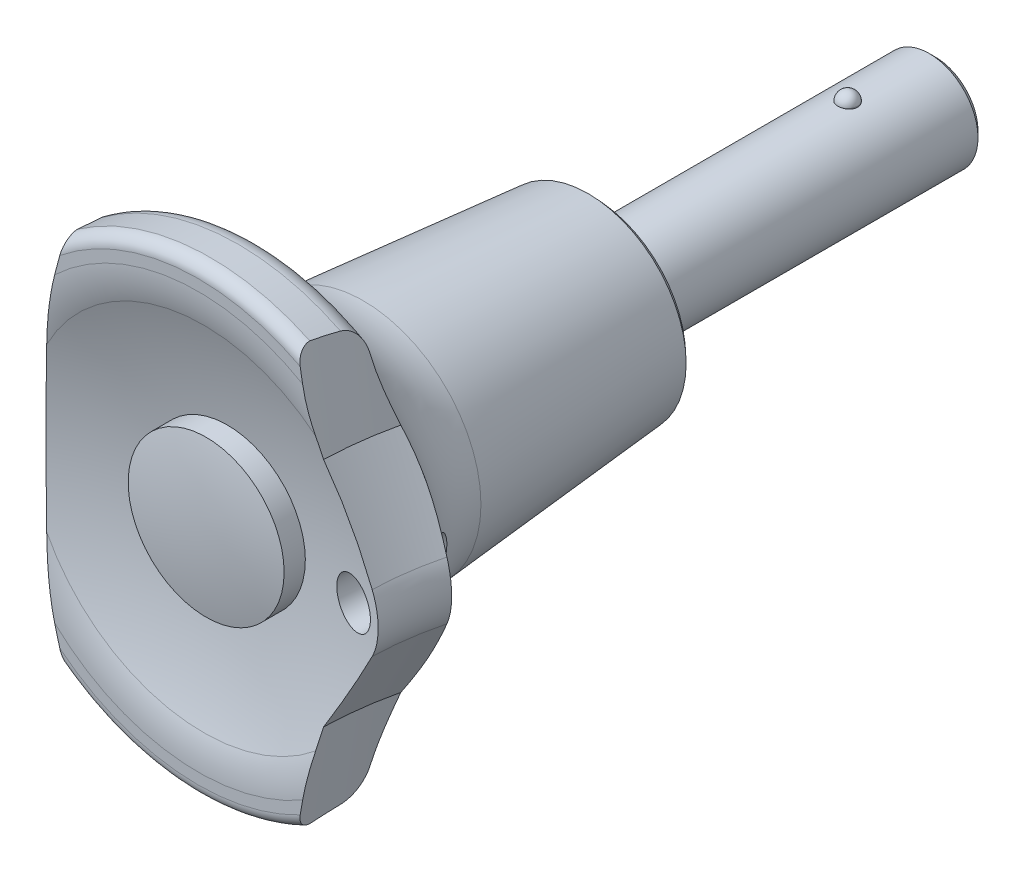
ISO-10303-21;
HEADER;
FILE_DESCRIPTION(('STEP AP214'),'2;1');
FILE_NAME('part.step','',(''),(''),'','','');
FILE_SCHEMA(('AUTOMOTIVE_DESIGN { 1 0 10303 214 1 1 1 1 }'));
ENDSEC;
DATA;
#1=APPLICATION_CONTEXT('core data for automotive mechanical design processes');
#2=APPLICATION_PROTOCOL_DEFINITION('international standard','automotive_design',2000,#1);
#3=PRODUCT_CONTEXT('',#1,'mechanical');
#4=PRODUCT('Part','Part','',(#3));
#5=PRODUCT_RELATED_PRODUCT_CATEGORY('part','',(#4));
#6=PRODUCT_DEFINITION_FORMATION('','',#4);
#7=PRODUCT_DEFINITION_CONTEXT('part definition',#1,'design');
#8=PRODUCT_DEFINITION('design','',#6,#7);
#9=PRODUCT_DEFINITION_SHAPE('','',#8);
#10=(LENGTH_UNIT() NAMED_UNIT(*) SI_UNIT(.MILLI.,.METRE.));
#11=(NAMED_UNIT(*) PLANE_ANGLE_UNIT() SI_UNIT($,.RADIAN.));
#12=(NAMED_UNIT(*) SI_UNIT($,.STERADIAN.) SOLID_ANGLE_UNIT());
#13=UNCERTAINTY_MEASURE_WITH_UNIT(LENGTH_MEASURE(1.E-05),#10,'distance_accuracy_value','');
#14=(GEOMETRIC_REPRESENTATION_CONTEXT(3) GLOBAL_UNCERTAINTY_ASSIGNED_CONTEXT((#13)) GLOBAL_UNIT_ASSIGNED_CONTEXT((#10,
#11,#12)) REPRESENTATION_CONTEXT('',''));
#15=CARTESIAN_POINT('',(0.,0.,0.));
#16=DIRECTION('',(0.,0.,1.));
#17=DIRECTION('',(1.,0.,0.));
#18=AXIS2_PLACEMENT_3D('',#15,#16,#17);
#19=CARTESIAN_POINT('',(0.,1.75,-28.));
#20=DIRECTION('',(0.,0.,-1.));
#21=DIRECTION('',(-1.,0.,0.));
#22=AXIS2_PLACEMENT_3D('',#19,#20,#21);
#23=PLANE('',#22);
#24=CARTESIAN_POINT('',(0.,0.,-28.00000000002));
#25=DIRECTION('',(0.,0.,1.));
#26=DIRECTION('',(1.,0.,0.));
#27=AXIS2_PLACEMENT_3D('',#24,#25,#26);
#28=CIRCLE('',#27,3.50000000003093);
#29=CARTESIAN_POINT('',(3.50000000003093,0.,-28.00000000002));
#30=VERTEX_POINT('',#29);
#31=EDGE_CURVE('E529',#30,#30,#28,.T.);
#32=ORIENTED_EDGE('',*,*,#31,.F.);
#33=EDGE_LOOP('',(#32));
#34=FACE_BOUND('',#33,.T.);
#35=ADVANCED_FACE('F14',(#34),#23,.T.);
#36=CARTESIAN_POINT('',(0.,-3.94833333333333,-20.8));
#37=DIRECTION('',(1.,0.,0.));
#38=DIRECTION('',(0.,1.,0.));
#39=AXIS2_PLACEMENT_3D('',#36,#37,#38);
#40=SPHERICAL_SURFACE('',#39,0.801666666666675);
#41=CARTESIAN_POINT('',(0.,-3.99999999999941,-20.7999999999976));
#42=DIRECTION('',(0.,1.,-5.97983654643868E-13));
#43=DIRECTION('',(0.,5.97983654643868E-13,1.));
#44=AXIS2_PLACEMENT_3D('',#41,#42,#43);
#45=CIRCLE('',#44,0.8);
#46=CARTESIAN_POINT('',(0.,-3.99999999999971,-21.5999999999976));
#47=VERTEX_POINT('',#46);
#48=CARTESIAN_POINT('',(0.,-3.99999999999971,-19.9999999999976));
#49=VERTEX_POINT('',#48);
#50=EDGE_CURVE('E521',#47,#49,#45,.T.);
#51=ORIENTED_EDGE('',*,*,#50,.F.);
#52=CARTESIAN_POINT('',(0.,-3.99999999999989,-20.7999999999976));
#53=DIRECTION('',(0.,1.,-5.97983654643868E-13));
#54=DIRECTION('',(0.,5.97983654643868E-13,1.));
#55=AXIS2_PLACEMENT_3D('',#52,#53,#54);
#56=CIRCLE('',#55,0.8);
#57=EDGE_CURVE('E491',#49,#47,#56,.T.);
#58=ORIENTED_EDGE('',*,*,#57,.F.);
#59=EDGE_LOOP('',(#51,#58));
#60=FACE_BOUND('',#59,.T.);
#61=ADVANCED_FACE('F502',(#60),#40,.T.);
#62=CARTESIAN_POINT('',(0.,0.,-20.8));
#63=DIRECTION('',(0.,1.,-5.97983654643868E-13));
#64=DIRECTION('',(0.,5.97983654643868E-13,1.));
#65=AXIS2_PLACEMENT_3D('',#62,#63,#64);
#66=CYLINDRICAL_SURFACE('',#65,0.8);
#67=CARTESIAN_POINT('',(0.,4.00000000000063,-21.6000000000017));
#68=CARTESIAN_POINT('',(0.0445375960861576,4.00002795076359,-21.6000403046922));
#69=CARTESIAN_POINT('',(0.0890541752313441,3.99925700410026,-21.5962833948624));
#70=CARTESIAN_POINT('',(0.176745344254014,3.99632620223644,-21.5814842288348));
#71=CARTESIAN_POINT('',(0.219921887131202,3.99416847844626,-21.5704531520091));
#72=CARTESIAN_POINT('',(0.303782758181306,3.98867145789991,-21.5414110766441));
#73=CARTESIAN_POINT('',(0.344466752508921,3.98533200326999,-21.5233991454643));
#74=CARTESIAN_POINT('',(0.422240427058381,3.97784324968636,-21.4809370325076));
#75=CARTESIAN_POINT('',(0.459329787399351,3.97369387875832,-21.4564862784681));
#76=CARTESIAN_POINT('',(0.529353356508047,3.96497766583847,-21.4014906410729));
#77=CARTESIAN_POINT('',(0.562232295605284,3.96040640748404,-21.3708760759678));
#78=CARTESIAN_POINT('',(0.622426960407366,3.95139379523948,-21.3045691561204));
#79=CARTESIAN_POINT('',(0.64974176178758,3.9469524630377,-21.2688759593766));
#80=CARTESIAN_POINT('',(0.698266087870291,3.9386594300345,-21.1930260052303));
#81=CARTESIAN_POINT('',(0.719417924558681,3.93481344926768,-21.1528316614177));
#82=CARTESIAN_POINT('',(0.75464531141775,3.92820998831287,-21.0693721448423));
#83=CARTESIAN_POINT('',(0.768721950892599,3.92545234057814,-21.0261074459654));
#84=CARTESIAN_POINT('',(0.789220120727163,3.92138246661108,-20.9383330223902));
#85=CARTESIAN_POINT('',(0.79573944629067,3.92005179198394,-20.8938470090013));
#86=CARTESIAN_POINT('',(0.801241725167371,3.91893099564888,-20.8043931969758));
#87=CARTESIAN_POINT('',(0.800225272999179,3.91914075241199,-20.7594254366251));
#88=CARTESIAN_POINT('',(0.790763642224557,3.92106041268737,-20.6710024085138));
#89=CARTESIAN_POINT('',(0.782430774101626,3.92274763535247,-20.6275345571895));
#90=CARTESIAN_POINT('',(0.75875019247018,3.92739639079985,-20.5426268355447));
#91=CARTESIAN_POINT('',(0.743402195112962,3.93035797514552,-20.5011870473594));
#92=CARTESIAN_POINT('',(0.706019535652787,3.93724500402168,-20.4211871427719));
#93=CARTESIAN_POINT('',(0.683940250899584,3.94117684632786,-20.3826484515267));
#94=CARTESIAN_POINT('',(0.633753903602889,3.94955709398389,-20.3097822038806));
#95=CARTESIAN_POINT('',(0.605646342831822,3.95400554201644,-20.2754549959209));
#96=CARTESIAN_POINT('',(0.543604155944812,3.96301558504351,-20.2113406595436));
#97=CARTESIAN_POINT('',(0.509574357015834,3.96757778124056,-20.1816456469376));
#98=CARTESIAN_POINT('',(0.436957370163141,3.9762297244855,-20.1283630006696));
#99=CARTESIAN_POINT('',(0.398368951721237,3.98031934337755,-20.1047770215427));
#100=CARTESIAN_POINT('',(0.317622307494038,3.987576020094,-20.0643643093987));
#101=CARTESIAN_POINT('',(0.275456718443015,3.99074111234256,-20.0475519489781));
#102=CARTESIAN_POINT('',(0.188849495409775,3.99577375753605,-20.021298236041));
#103=CARTESIAN_POINT('',(0.144411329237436,3.99764322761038,-20.011845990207));
#104=CARTESIAN_POINT('',(0.0830150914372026,3.99917303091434,-20.0041437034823));
#105=CARTESIAN_POINT('',(0.0664370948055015,3.99948283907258,-20.0025892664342));
#106=CARTESIAN_POINT('',(0.033241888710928,3.99989614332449,-20.0005187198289));
#107=CARTESIAN_POINT('',(0.0166247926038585,3.99999998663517,-20.0000008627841));
#108=CARTESIAN_POINT('',(0.,4.,-20.0000000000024));
#109=B_SPLINE_CURVE_WITH_KNOTS('',3,(#67,#68,#69,#70,#71,#72,#73,#74,#75,#76,#77,#78,#79,#80,
#81,#82,#83,#84,#85,#86,#87,#88,#89,#90,#91,#92,#93,#94,#95,#96,#97,#98,#99,#100,#101,#102,#103,
#104,#105,#106,#107,#108),.UNSPECIFIED.,.F.,.F.,(4,2,2,2,2,2,2,2,2,2,2,2,2,2,2,2,2,2,2,2,4),(0.,
0.133416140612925,0.266627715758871,0.399857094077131,0.533098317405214,0.667940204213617,
0.802804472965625,0.938893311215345,1.07496119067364,1.20924790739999,1.34352402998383,
1.47577429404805,1.60802990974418,1.7411820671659,1.87434523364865,2.00988854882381,
2.14546853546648,2.28133470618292,2.41699940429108,2.46693430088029,2.51678494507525),.UNSPECIFIED.);
#110=CARTESIAN_POINT('',(0.,4.00000000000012,-21.6000000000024));
#111=VERTEX_POINT('',#110);
#112=CARTESIAN_POINT('',(0.,4.00000000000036,-20.0000000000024));
#113=VERTEX_POINT('',#112);
#114=EDGE_CURVE('E41',#111,#113,#109,.T.);
#115=ORIENTED_EDGE('',*,*,#114,.F.);
#116=CARTESIAN_POINT('',(0.,4.00000000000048,-20.8000000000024));
#117=DIRECTION('',(0.,1.,-5.97983654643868E-13));
#118=DIRECTION('',(0.,5.97983654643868E-13,1.));
#119=AXIS2_PLACEMENT_3D('',#116,#117,#118);
#120=CIRCLE('',#119,0.8);
#121=EDGE_CURVE('E31',#113,#111,#120,.T.);
#122=ORIENTED_EDGE('',*,*,#121,.F.);
#123=EDGE_LOOP('',(#115,#122));
#124=FACE_BOUND('',#123,.T.);
#125=ADVANCED_FACE('F505',(#124),#66,.T.);
#126=CARTESIAN_POINT('',(0.,0.,-20.8));
#127=DIRECTION('',(0.,1.,-5.97983654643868E-13));
#128=DIRECTION('',(0.,5.97983654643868E-13,1.));
#129=AXIS2_PLACEMENT_3D('',#126,#127,#128);
#130=CYLINDRICAL_SURFACE('',#129,0.8);
#131=CARTESIAN_POINT('',(0.,-4.00000000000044,-19.999999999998));
#132=CARTESIAN_POINT('',(0.0445375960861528,-4.00002795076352,-19.9999596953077));
#133=CARTESIAN_POINT('',(0.0890541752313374,-3.99925700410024,-20.0037166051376));
#134=CARTESIAN_POINT('',(0.176745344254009,-3.99632620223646,-20.0185157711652));
#135=CARTESIAN_POINT('',(0.219921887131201,-3.99416847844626,-20.0295468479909));
#136=CARTESIAN_POINT('',(0.303782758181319,-3.98867145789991,-20.0585889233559));
#137=CARTESIAN_POINT('',(0.344466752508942,-3.98533200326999,-20.0766008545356));
#138=CARTESIAN_POINT('',(0.422240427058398,-3.97784324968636,-20.1190629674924));
#139=CARTESIAN_POINT('',(0.459329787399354,-3.97369387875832,-20.1435137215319));
#140=CARTESIAN_POINT('',(0.529353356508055,-3.96497766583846,-20.1985093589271));
#141=CARTESIAN_POINT('',(0.562232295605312,-3.96040640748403,-20.2291239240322));
#142=CARTESIAN_POINT('',(0.622426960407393,-3.95139379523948,-20.2954308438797));
#143=CARTESIAN_POINT('',(0.649741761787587,-3.9469524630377,-20.3311240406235));
#144=CARTESIAN_POINT('',(0.698266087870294,-3.9386594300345,-20.4069739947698));
#145=CARTESIAN_POINT('',(0.719417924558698,-3.93481344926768,-20.4471683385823));
#146=CARTESIAN_POINT('',(0.754645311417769,-3.92820998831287,-20.5306278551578));
#147=CARTESIAN_POINT('',(0.768721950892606,-3.92545234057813,-20.5738925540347));
#148=CARTESIAN_POINT('',(0.78922012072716,-3.92138246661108,-20.6616669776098));
#149=CARTESIAN_POINT('',(0.795739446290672,-3.92005179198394,-20.7061529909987));
#150=CARTESIAN_POINT('',(0.801241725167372,-3.91893099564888,-20.7956068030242));
#151=CARTESIAN_POINT('',(0.800225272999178,-3.91914075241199,-20.8405745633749));
#152=CARTESIAN_POINT('',(0.790763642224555,-3.92106041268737,-20.9289975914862));
#153=CARTESIAN_POINT('',(0.782430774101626,-3.92274763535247,-20.9724654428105));
#154=CARTESIAN_POINT('',(0.758750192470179,-3.92739639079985,-21.0573731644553));
#155=CARTESIAN_POINT('',(0.743402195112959,-3.93035797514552,-21.0988129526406));
#156=CARTESIAN_POINT('',(0.706019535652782,-3.93724500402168,-21.1788128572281));
#157=CARTESIAN_POINT('',(0.68394025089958,-3.94117684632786,-21.2173515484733));
#158=CARTESIAN_POINT('',(0.633753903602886,-3.94955709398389,-21.2902177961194));
#159=CARTESIAN_POINT('',(0.605646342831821,-3.95400554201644,-21.3245450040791));
#160=CARTESIAN_POINT('',(0.543604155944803,-3.96301558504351,-21.3886593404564));
#161=CARTESIAN_POINT('',(0.509574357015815,-3.96757778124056,-21.4183543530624));
#162=CARTESIAN_POINT('',(0.436957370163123,-3.9762297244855,-21.4716369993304));
#163=CARTESIAN_POINT('',(0.39836895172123,-3.98031934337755,-21.4952229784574));
#164=CARTESIAN_POINT('',(0.317622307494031,-3.987576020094,-21.5356356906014));
#165=CARTESIAN_POINT('',(0.275456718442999,-3.99074111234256,-21.552448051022));
#166=CARTESIAN_POINT('',(0.188849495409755,-3.99577375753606,-21.578701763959));
#167=CARTESIAN_POINT('',(0.144411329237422,-3.99764322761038,-21.588154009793));
#168=CARTESIAN_POINT('',(0.0830150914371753,-3.99917303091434,-21.5958562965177));
#169=CARTESIAN_POINT('',(0.066437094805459,-3.99948283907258,-21.5974107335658));
#170=CARTESIAN_POINT('',(0.0332418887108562,-3.9998961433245,-21.5994812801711));
#171=CARTESIAN_POINT('',(0.0166247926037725,-3.99999998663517,-21.5999991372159));
#172=CARTESIAN_POINT('',(0.,-4.,-21.5999999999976));
#173=B_SPLINE_CURVE_WITH_KNOTS('',3,(#131,#132,#133,#134,#135,#136,#137,#138,#139,#140,#141,
#142,#143,#144,#145,#146,#147,#148,#149,#150,#151,#152,#153,#154,#155,#156,#157,#158,#159,#160,
#161,#162,#163,#164,#165,#166,#167,#168,#169,#170,#171,#172),.UNSPECIFIED.,.F.,.F.,(4,2,2,2,2,2,
2,2,2,2,2,2,2,2,2,2,2,2,2,2,4),(0.,0.133416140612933,0.266627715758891,0.399857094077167,
0.533098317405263,0.667940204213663,0.802804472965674,0.938893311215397,1.0749611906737,
1.20924790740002,1.34352402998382,1.47577429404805,1.60802990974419,1.7411820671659,
1.87434523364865,2.00988854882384,2.14546853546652,2.28133470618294,2.4169994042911,
2.46693430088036,2.51678494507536),.UNSPECIFIED.);
#174=EDGE_CURVE('E520',#49,#47,#173,.T.);
#175=ORIENTED_EDGE('',*,*,#174,.F.);
#176=ORIENTED_EDGE('',*,*,#57,.T.);
#177=EDGE_LOOP('',(#175,#176));
#178=FACE_BOUND('',#177,.T.);
#179=ADVANCED_FACE('F510',(#178),#130,.T.);
#180=CARTESIAN_POINT('',(0.,3.94833333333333,-20.8));
#181=DIRECTION('',(1.,0.,0.));
#182=DIRECTION('',(0.,1.,0.));
#183=AXIS2_PLACEMENT_3D('',#180,#181,#182);
#184=SPHERICAL_SURFACE('',#183,0.801666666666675);
#185=CARTESIAN_POINT('',(0.,3.99999999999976,-20.8000000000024));
#186=DIRECTION('',(0.,1.,-5.97983654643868E-13));
#187=DIRECTION('',(0.,5.97983654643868E-13,1.));
#188=AXIS2_PLACEMENT_3D('',#185,#186,#187);
#189=CIRCLE('',#188,0.8);
#190=EDGE_CURVE('E541',#113,#111,#189,.F.);
#191=ORIENTED_EDGE('',*,*,#190,.F.);
#192=ORIENTED_EDGE('',*,*,#121,.T.);
#193=EDGE_LOOP('',(#191,#192));
#194=FACE_BOUND('',#193,.T.);
#195=ADVANCED_FACE('F574',(#194),#184,.T.);
#196=CARTESIAN_POINT('',(0.,0.,-27.5000000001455));
#197=DIRECTION('',(0.,0.,1.));
#198=DIRECTION('',(1.,0.,0.));
#199=AXIS2_PLACEMENT_3D('',#196,#197,#198);
#200=CONICAL_SURFACE('',#199,3.99999999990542,0.785398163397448);
#201=ORIENTED_EDGE('',*,*,#31,.T.);
#202=EDGE_LOOP('',(#201));
#203=FACE_BOUND('',#202,.T.);
#204=CARTESIAN_POINT('',(0.,0.,-27.5));
#205=DIRECTION('',(0.,0.,1.));
#206=DIRECTION('',(1.,0.,0.));
#207=AXIS2_PLACEMENT_3D('',#204,#205,#206);
#208=CIRCLE('',#207,4.);
#209=CARTESIAN_POINT('',(4.,0.,-27.5));
#210=VERTEX_POINT('',#209);
#211=EDGE_CURVE('E544',#210,#210,#208,.T.);
#212=ORIENTED_EDGE('',*,*,#211,.F.);
#213=EDGE_LOOP('',(#212));
#214=FACE_BOUND('',#213,.T.);
#215=ADVANCED_FACE('F562',(#203,#214),#200,.T.);
#216=CARTESIAN_POINT('',(0.,0.,-20.8));
#217=DIRECTION('',(0.,1.,-5.97983654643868E-13));
#218=DIRECTION('',(0.,5.97983654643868E-13,1.));
#219=AXIS2_PLACEMENT_3D('',#216,#217,#218);
#220=CYLINDRICAL_SURFACE('',#219,0.8);
#221=CARTESIAN_POINT('',(0.,-4.00000000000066,-21.5999999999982));
#222=CARTESIAN_POINT('',(-0.0445375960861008,-4.0000279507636,-21.6000403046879));
#223=CARTESIAN_POINT('',(-0.089054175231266,-3.99925700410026,-21.5962833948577));
#224=CARTESIAN_POINT('',(-0.176745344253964,-3.99632620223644,-21.5814842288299));
#225=CARTESIAN_POINT('',(-0.2199218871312,-3.99416847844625,-21.5704531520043));
#226=CARTESIAN_POINT('',(-0.303782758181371,-3.98867145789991,-21.5414110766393));
#227=CARTESIAN_POINT('',(-0.344466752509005,-3.98533200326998,-21.5233991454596));
#228=CARTESIAN_POINT('',(-0.422240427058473,-3.97784324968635,-21.4809370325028));
#229=CARTESIAN_POINT('',(-0.459329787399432,-3.97369387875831,-21.4564862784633));
#230=CARTESIAN_POINT('',(-0.529353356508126,-3.96497766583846,-21.4014906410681));
#231=CARTESIAN_POINT('',(-0.562232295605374,-3.96040640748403,-21.370876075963));
#232=CARTESIAN_POINT('',(-0.622426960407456,-3.95139379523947,-21.3045691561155));
#233=CARTESIAN_POINT('',(-0.649741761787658,-3.94695246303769,-21.2688759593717));
#234=CARTESIAN_POINT('',(-0.698266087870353,-3.93865943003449,-21.1930260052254));
#235=CARTESIAN_POINT('',(-0.71941792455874,-3.93481344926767,-21.1528316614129));
#236=CARTESIAN_POINT('',(-0.754645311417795,-3.92820998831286,-21.0693721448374));
#237=CARTESIAN_POINT('',(-0.768721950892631,-3.92545234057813,-21.0261074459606));
#238=CARTESIAN_POINT('',(-0.789220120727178,-3.92138246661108,-20.9383330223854));
#239=CARTESIAN_POINT('',(-0.795739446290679,-3.92005179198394,-20.8938470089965));
#240=CARTESIAN_POINT('',(-0.801241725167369,-3.91893099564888,-20.8043931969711));
#241=CARTESIAN_POINT('',(-0.800225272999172,-3.91914075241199,-20.7594254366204));
#242=CARTESIAN_POINT('',(-0.790763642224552,-3.92106041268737,-20.6710024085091));
#243=CARTESIAN_POINT('',(-0.782430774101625,-3.92274763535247,-20.6275345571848));
#244=CARTESIAN_POINT('',(-0.758750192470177,-3.92739639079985,-20.54262683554));
#245=CARTESIAN_POINT('',(-0.743402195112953,-3.93035797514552,-20.5011870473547));
#246=CARTESIAN_POINT('',(-0.706019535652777,-3.93724500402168,-20.4211871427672));
#247=CARTESIAN_POINT('',(-0.683940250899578,-3.94117684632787,-20.382648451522));
#248=CARTESIAN_POINT('',(-0.633753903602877,-3.94955709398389,-20.3097822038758));
#249=CARTESIAN_POINT('',(-0.605646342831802,-3.95400554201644,-20.2754549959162));
#250=CARTESIAN_POINT('',(-0.543604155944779,-3.96301558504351,-20.2113406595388));
#251=CARTESIAN_POINT('',(-0.509574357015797,-3.96757778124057,-20.1816456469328));
#252=CARTESIAN_POINT('',(-0.436957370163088,-3.9762297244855,-20.1283630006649));
#253=CARTESIAN_POINT('',(-0.398368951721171,-3.98031934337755,-20.1047770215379));
#254=CARTESIAN_POINT('',(-0.317622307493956,-3.987576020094,-20.0643643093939));
#255=CARTESIAN_POINT('',(-0.275456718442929,-3.99074111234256,-20.0475519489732));
#256=CARTESIAN_POINT('',(-0.188849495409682,-3.99577375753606,-20.0212982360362));
#257=CARTESIAN_POINT('',(-0.14441132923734,-3.99764322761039,-20.0118459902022));
#258=CARTESIAN_POINT('',(-0.0830150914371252,-3.99917303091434,-20.0041437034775));
#259=CARTESIAN_POINT('',(-0.0664370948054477,-3.99948283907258,-20.0025892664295));
#260=CARTESIAN_POINT('',(-0.0332418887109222,-3.99989614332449,-20.0005187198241));
#261=CARTESIAN_POINT('',(-0.0166247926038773,-3.99999998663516,-20.0000008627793));
#262=CARTESIAN_POINT('',(0.,-4.,-19.9999999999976));
#263=B_SPLINE_CURVE_WITH_KNOTS('',3,(#221,#222,#223,#224,#225,#226,#227,#228,#229,#230,#231,
#232,#233,#234,#235,#236,#237,#238,#239,#240,#241,#242,#243,#244,#245,#246,#247,#248,#249,#250,
#251,#252,#253,#254,#255,#256,#257,#258,#259,#260,#261,#262),.UNSPECIFIED.,.F.,.F.,(4,2,2,2,2,2,
2,2,2,2,2,2,2,2,2,2,2,2,2,2,4),(0.,0.13341614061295,0.266627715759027,0.399857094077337,
0.533098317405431,0.667940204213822,0.80280447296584,0.938893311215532,1.07496119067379,
1.20924790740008,1.34352402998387,1.47577429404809,1.60802990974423,1.74118206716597,
1.87434523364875,2.00988854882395,2.14546853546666,2.2813347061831,2.41699940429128,
2.46693430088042,2.5167849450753),.UNSPECIFIED.);
#264=EDGE_CURVE('E540',#47,#49,#263,.T.);
#265=ORIENTED_EDGE('',*,*,#264,.F.);
#266=ORIENTED_EDGE('',*,*,#50,.T.);
#267=EDGE_LOOP('',(#265,#266));
#268=FACE_BOUND('',#267,.T.);
#269=ADVANCED_FACE('F543',(#268),#220,.T.);
#270=CARTESIAN_POINT('',(0.,0.,-20.8));
#271=DIRECTION('',(0.,1.,-5.97983654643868E-13));
#272=DIRECTION('',(0.,5.97983654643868E-13,1.));
#273=AXIS2_PLACEMENT_3D('',#270,#271,#272);
#274=CYLINDRICAL_SURFACE('',#273,0.8);
#275=CARTESIAN_POINT('',(0.,4.,-20.0000000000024));
#276=CARTESIAN_POINT('',(-0.0445375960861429,4.00002795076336,-19.9999596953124));
#277=CARTESIAN_POINT('',(-0.0890541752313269,3.9992570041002,-20.0037166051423));
#278=CARTESIAN_POINT('',(-0.17674534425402,3.9963262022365,-20.01851577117));
#279=CARTESIAN_POINT('',(-0.219921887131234,3.99416847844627,-20.0295468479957));
#280=CARTESIAN_POINT('',(-0.30378275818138,3.98867145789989,-20.0585889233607));
#281=CARTESIAN_POINT('',(-0.34446675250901,3.98533200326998,-20.0766008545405));
#282=CARTESIAN_POINT('',(-0.422240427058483,3.97784324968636,-20.1190629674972));
#283=CARTESIAN_POINT('',(-0.45932978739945,3.97369387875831,-20.1435137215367));
#284=CARTESIAN_POINT('',(-0.529353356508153,3.96497766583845,-20.1985093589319));
#285=CARTESIAN_POINT('',(-0.562232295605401,3.96040640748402,-20.229123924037));
#286=CARTESIAN_POINT('',(-0.622426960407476,3.95139379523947,-20.2954308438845));
#287=CARTESIAN_POINT('',(-0.649741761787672,3.94695246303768,-20.3311240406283));
#288=CARTESIAN_POINT('',(-0.698266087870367,3.93865943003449,-20.4069739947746));
#289=CARTESIAN_POINT('',(-0.719417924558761,3.93481344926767,-20.4471683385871));
#290=CARTESIAN_POINT('',(-0.754645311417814,3.92820998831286,-20.5306278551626));
#291=CARTESIAN_POINT('',(-0.768721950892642,3.92545234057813,-20.5738925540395));
#292=CARTESIAN_POINT('',(-0.78922012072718,3.92138246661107,-20.6616669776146));
#293=CARTESIAN_POINT('',(-0.795739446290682,3.92005179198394,-20.7061529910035));
#294=CARTESIAN_POINT('',(-0.801241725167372,3.91893099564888,-20.795606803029));
#295=CARTESIAN_POINT('',(-0.800225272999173,3.91914075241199,-20.8405745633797));
#296=CARTESIAN_POINT('',(-0.790763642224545,3.92106041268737,-20.928997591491));
#297=CARTESIAN_POINT('',(-0.782430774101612,3.92274763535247,-20.9724654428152));
#298=CARTESIAN_POINT('',(-0.758750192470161,3.92739639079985,-21.0573731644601));
#299=CARTESIAN_POINT('',(-0.743402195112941,3.93035797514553,-21.0988129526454));
#300=CARTESIAN_POINT('',(-0.706019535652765,3.93724500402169,-21.1788128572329));
#301=CARTESIAN_POINT('',(-0.683940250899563,3.94117684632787,-21.217351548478));
#302=CARTESIAN_POINT('',(-0.633753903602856,3.94955709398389,-21.2902177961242));
#303=CARTESIAN_POINT('',(-0.605646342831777,3.95400554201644,-21.3245450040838));
#304=CARTESIAN_POINT('',(-0.543604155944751,3.96301558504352,-21.3886593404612));
#305=CARTESIAN_POINT('',(-0.509574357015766,3.96757778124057,-21.4183543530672));
#306=CARTESIAN_POINT('',(-0.43695737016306,3.97622972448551,-21.4716369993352));
#307=CARTESIAN_POINT('',(-0.398368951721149,3.98031934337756,-21.4952229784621));
#308=CARTESIAN_POINT('',(-0.317622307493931,3.98757602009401,-21.5356356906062));
#309=CARTESIAN_POINT('',(-0.275456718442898,3.99074111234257,-21.5524480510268));
#310=CARTESIAN_POINT('',(-0.188849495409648,3.99577375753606,-21.5787017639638));
#311=CARTESIAN_POINT('',(-0.144411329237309,3.99764322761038,-21.5881540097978));
#312=CARTESIAN_POINT('',(-0.0830150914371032,3.99917303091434,-21.5958562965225));
#313=CARTESIAN_POINT('',(-0.0664370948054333,3.99948283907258,-21.5974107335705));
#314=CARTESIAN_POINT('',(-0.0332418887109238,3.99989614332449,-21.5994812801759));
#315=CARTESIAN_POINT('',(-0.0166247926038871,3.99999998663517,-21.5999991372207));
#316=CARTESIAN_POINT('',(0.,4.,-21.6000000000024));
#317=B_SPLINE_CURVE_WITH_KNOTS('',3,(#275,#276,#277,#278,#279,#280,#281,#282,#283,#284,#285,
#286,#287,#288,#289,#290,#291,#292,#293,#294,#295,#296,#297,#298,#299,#300,#301,#302,#303,#304,
#305,#306,#307,#308,#309,#310,#311,#312,#313,#314,#315,#316),.UNSPECIFIED.,.F.,.F.,(4,2,2,2,2,2,
2,2,2,2,2,2,2,2,2,2,2,2,2,2,4),(0.,0.133416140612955,0.266627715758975,0.399857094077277,
0.533098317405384,0.667940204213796,0.802804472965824,0.938893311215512,1.07496119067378,
1.20924790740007,1.34352402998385,1.47577429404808,1.60802990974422,1.74118206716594,
1.8743452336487,2.00988854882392,2.14546853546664,2.28133470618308,2.41699940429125,
2.46693430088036,2.51678494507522),.UNSPECIFIED.);
#318=EDGE_CURVE('E24',#113,#111,#317,.T.);
#319=ORIENTED_EDGE('',*,*,#318,.F.);
#320=ORIENTED_EDGE('',*,*,#190,.T.);
#321=EDGE_LOOP('',(#319,#320));
#322=FACE_BOUND('',#321,.T.);
#323=ADVANCED_FACE('F561',(#322),#274,.T.);
#324=CARTESIAN_POINT('',(0.,0.,-5.625));
#325=DIRECTION('',(0.,0.,1.));
#326=DIRECTION('',(1.,0.,0.));
#327=AXIS2_PLACEMENT_3D('',#324,#325,#326);
#328=CYLINDRICAL_SURFACE('',#327,4.);
#329=CARTESIAN_POINT('',(0.,0.,0.));
#330=DIRECTION('',(0.,0.,-1.));
#331=DIRECTION('',(-1.,0.,0.));
#332=AXIS2_PLACEMENT_3D('',#329,#330,#331);
#333=CIRCLE('',#332,4.);
#334=CARTESIAN_POINT('',(-4.,0.,0.));
#335=VERTEX_POINT('',#334);
#336=EDGE_CURVE('E9',#335,#335,#333,.F.);
#337=ORIENTED_EDGE('',*,*,#336,.F.);
#338=EDGE_LOOP('',(#337));
#339=FACE_BOUND('',#338,.T.);
#340=ORIENTED_EDGE('',*,*,#211,.T.);
#341=EDGE_LOOP('',(#340));
#342=FACE_BOUND('',#341,.T.);
#343=ORIENTED_EDGE('',*,*,#174,.T.);
#344=ORIENTED_EDGE('',*,*,#264,.T.);
#345=EDGE_LOOP('',(#343,#344));
#346=FACE_BOUND('',#345,.T.);
#347=ORIENTED_EDGE('',*,*,#318,.T.);
#348=ORIENTED_EDGE('',*,*,#114,.T.);
#349=EDGE_LOOP('',(#347,#348));
#350=FACE_BOUND('',#349,.T.);
#351=ADVANCED_FACE('F16',(#339,#342,#346,#350),#328,.T.);
#352=CARTESIAN_POINT('',(0.,1.03504969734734E-13,0.667307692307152));
#353=DIRECTION('',(1.,0.,0.));
#354=DIRECTION('',(0.,1.,0.));
#355=AXIS2_PLACEMENT_3D('',#352,#353,#354);
#356=SPHERICAL_SURFACE('',#355,31.8326923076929);
#357=CARTESIAN_POINT('',(0.,0.,31.85));
#358=DIRECTION('',(0.,0.,1.));
#359=DIRECTION('',(1.,0.,0.));
#360=AXIS2_PLACEMENT_3D('',#357,#358,#359);
#361=CIRCLE('',#360,6.4);
#362=CARTESIAN_POINT('',(6.4,0.,31.85));
#363=VERTEX_POINT('',#362);
#364=EDGE_CURVE('E471',#363,#363,#361,.F.);
#365=ORIENTED_EDGE('',*,*,#364,.F.);
#366=EDGE_LOOP('',(#365));
#367=FACE_BOUND('',#366,.T.);
#368=ADVANCED_FACE('F476',(#367),#356,.T.);
#369=CARTESIAN_POINT('',(0.,0.,24.05));
#370=DIRECTION('',(0.,0.,1.));
#371=DIRECTION('',(1.,0.,0.));
#372=AXIS2_PLACEMENT_3D('',#369,#370,#371);
#373=CYLINDRICAL_SURFACE('',#372,6.4);
#374=ORIENTED_EDGE('',*,*,#364,.T.);
#375=EDGE_LOOP('',(#374));
#376=FACE_BOUND('',#375,.T.);
#377=CARTESIAN_POINT('',(6.4,0.,30.1110590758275));
#378=CARTESIAN_POINT('',(6.40000129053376,-0.179810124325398,30.111059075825));
#379=CARTESIAN_POINT('',(6.39241914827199,-0.359599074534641,30.1110590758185));
#380=CARTESIAN_POINT('',(6.3621435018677,-0.71795909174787,30.1110590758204));
#381=CARTESIAN_POINT('',(6.33944602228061,-0.896529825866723,30.1110590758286));
#382=CARTESIAN_POINT('',(6.2790684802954,-1.25128110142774,30.1110590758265));
#383=CARTESIAN_POINT('',(6.24137507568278,-1.42745936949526,30.1110590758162));
#384=CARTESIAN_POINT('',(6.15125799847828,-1.77607703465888,30.1110590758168));
#385=CARTESIAN_POINT('',(6.09882894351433,-1.94851504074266,30.1110590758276));
#386=CARTESIAN_POINT('',(5.9796699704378,-2.2882129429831,30.1110590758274));
#387=CARTESIAN_POINT('',(5.91295217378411,-2.45547709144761,30.1110590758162));
#388=CARTESIAN_POINT('',(5.76563661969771,-2.7838514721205,30.1110590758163));
#389=CARTESIAN_POINT('',(5.68503375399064,-2.9449594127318,30.1110590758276));
#390=CARTESIAN_POINT('',(5.51059240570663,-3.25971260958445,30.1110590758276));
#391=CARTESIAN_POINT('',(5.4167621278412,-3.41336241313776,30.1110590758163));
#392=CARTESIAN_POINT('',(5.21645805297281,-3.71226938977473,30.1110590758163));
#393=CARTESIAN_POINT('',(5.10997960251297,-3.85752344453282,30.1110590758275));
#394=CARTESIAN_POINT('',(4.88519374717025,-4.13850742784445,30.1110590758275));
#395=CARTESIAN_POINT('',(4.76688947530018,-4.27423986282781,30.1110590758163));
#396=CARTESIAN_POINT('',(4.51922341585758,-4.53530651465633,30.1110590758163));
#397=CARTESIAN_POINT('',(4.38985756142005,-4.66063687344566,30.1110590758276));
#398=CARTESIAN_POINT('',(4.12107041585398,-4.89991253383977,30.1110590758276));
#399=CARTESIAN_POINT('',(3.98165245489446,-5.01386157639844,30.1110590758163));
#400=CARTESIAN_POINT('',(3.69366097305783,-5.22965167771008,30.1110590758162));
#401=CARTESIAN_POINT('',(3.54508409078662,-5.33148825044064,30.1110590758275));
#402=CARTESIAN_POINT('',(3.23993719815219,-5.52224318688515,30.1110590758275));
#403=CARTESIAN_POINT('',(3.08337030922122,-5.61116654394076,30.1110590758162));
#404=CARTESIAN_POINT('',(2.76324420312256,-5.77554056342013,30.1110590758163));
#405=CARTESIAN_POINT('',(2.59968242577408,-5.85098623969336,30.1110590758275));
#406=CARTESIAN_POINT('',(2.2668445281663,-5.98780235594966,30.1110590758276));
#407=CARTESIAN_POINT('',(2.0975705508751,-6.04917800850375,30.1110590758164));
#408=CARTESIAN_POINT('',(1.75439473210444,-6.15747441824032,30.1110590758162));
#409=CARTESIAN_POINT('',(1.58049120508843,-6.20438983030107,30.1110590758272));
#410=CARTESIAN_POINT('',(1.22940084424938,-6.283384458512,30.1110590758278));
#411=CARTESIAN_POINT('',(1.05221523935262,-6.31546911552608,30.1110590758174));
#412=CARTESIAN_POINT('',(0.695754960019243,-6.36461764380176,30.1110590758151));
#413=CARTESIAN_POINT('',(0.516479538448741,-6.38167596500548,30.1110590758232));
#414=CARTESIAN_POINT('',(-0.0224375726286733,-6.41003711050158,30.1110590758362));
#415=CARTESIAN_POINT('',(-0.383552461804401,-6.39861178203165,30.1110590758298));
#416=CARTESIAN_POINT('',(-1.09854136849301,-6.31529390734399,30.1110590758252));
#417=CARTESIAN_POINT('',(-1.45241538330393,-6.24340133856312,30.1110590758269));
#418=CARTESIAN_POINT('',(-2.14312422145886,-6.04122706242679,30.1110590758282));
#419=CARTESIAN_POINT('',(-2.47995902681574,-5.91094529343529,30.1110590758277));
#420=CARTESIAN_POINT('',(-3.12696102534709,-5.59568095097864,30.1110590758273));
#421=CARTESIAN_POINT('',(-3.43712822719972,-5.41069839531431,30.1110590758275));
#422=CARTESIAN_POINT('',(-4.02200801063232,-4.99128634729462,30.1110590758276));
#423=CARTESIAN_POINT('',(-4.29672060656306,-4.75685687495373,30.1110590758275));
#424=CARTESIAN_POINT('',(-4.80288833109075,-4.24520495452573,30.1110590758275));
#425=CARTESIAN_POINT('',(-5.03434345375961,-3.96798250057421,30.1110590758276));
#426=CARTESIAN_POINT('',(-5.4474271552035,-3.37861432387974,30.1110590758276));
#427=CARTESIAN_POINT('',(-5.62905572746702,-3.06646859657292,30.1110590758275));
#428=CARTESIAN_POINT('',(-5.9373300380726,-2.41611476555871,30.1110590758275));
#429=CARTESIAN_POINT('',(-6.06397577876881,-2.0779066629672,30.1110590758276));
#430=CARTESIAN_POINT('',(-6.25868942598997,-1.38502883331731,30.1110590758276));
#431=CARTESIAN_POINT('',(-6.32675733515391,-1.03035910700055,30.1110590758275));
#432=CARTESIAN_POINT('',(-6.40238305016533,-0.314626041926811,30.1110590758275));
#433=CARTESIAN_POINT('',(-6.4099408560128,0.0464372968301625,30.1110590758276));
#434=CARTESIAN_POINT('',(-6.36433185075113,0.764708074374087,30.1110590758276));
#435=CARTESIAN_POINT('',(-6.31116503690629,1.12191551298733,30.1110590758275));
#436=CARTESIAN_POINT('',(-6.14561593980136,1.82233442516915,30.1110590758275));
#437=CARTESIAN_POINT('',(-6.0332336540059,2.16554589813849,30.1110590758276));
#438=CARTESIAN_POINT('',(-5.75244417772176,2.82823003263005,30.1110590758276));
#439=CARTESIAN_POINT('',(-5.58403699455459,3.14770269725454,30.1110590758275));
#440=CARTESIAN_POINT('',(-5.19597704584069,3.75384041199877,30.1110590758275));
#441=CARTESIAN_POINT('',(-4.97632428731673,4.04050546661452,30.1110590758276));
#442=CARTESIAN_POINT('',(-4.49201316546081,4.57289025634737,30.1110590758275));
#443=CARTESIAN_POINT('',(-4.22735478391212,4.81860997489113,30.1110590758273));
#444=CARTESIAN_POINT('',(-3.66052736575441,5.26212983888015,30.1110590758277));
#445=CARTESIAN_POINT('',(-3.35835831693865,5.45992996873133,30.1110590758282));
#446=CARTESIAN_POINT('',(-2.72515445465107,5.80199137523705,30.111059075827));
#447=CARTESIAN_POINT('',(-2.39411967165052,5.94625270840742,30.1110590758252));
#448=CARTESIAN_POINT('',(-1.71233203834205,6.17715664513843,30.1110590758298));
#449=CARTESIAN_POINT('',(-1.3615791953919,6.26379927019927,30.1110590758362));
#450=CARTESIAN_POINT('',(-0.828635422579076,6.34869298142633,30.1110590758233));
#451=CARTESIAN_POINT('',(-0.649753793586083,6.36947821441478,30.1110590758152));
#452=CARTESIAN_POINT('',(-0.29089341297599,6.3959118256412,30.1110590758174));
#453=CARTESIAN_POINT('',(-0.110915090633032,6.40156578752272,30.1110590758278));
#454=CARTESIAN_POINT('',(0.248931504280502,6.39769010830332,30.1110590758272));
#455=CARTESIAN_POINT('',(0.42879971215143,6.38815488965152,30.1110590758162));
#456=CARTESIAN_POINT('',(0.787030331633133,6.35397041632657,30.1110590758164));
#457=CARTESIAN_POINT('',(0.965393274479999,6.32932674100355,30.1110590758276));
#458=CARTESIAN_POINT('',(1.31947460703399,6.2650918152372,30.1110590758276));
#459=CARTESIAN_POINT('',(1.49519199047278,6.22549501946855,30.1110590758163));
#460=CARTESIAN_POINT('',(1.84260157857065,6.13165408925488,30.1110590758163));
#461=CARTESIAN_POINT('',(2.01429524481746,6.07741536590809,30.1110590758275));
#462=CARTESIAN_POINT('',(2.35256975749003,5.95464555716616,30.1110590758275));
#463=CARTESIAN_POINT('',(2.51914859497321,5.88610893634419,30.1110590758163));
#464=CARTESIAN_POINT('',(2.84587864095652,5.73527147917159,30.1110590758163));
#465=CARTESIAN_POINT('',(3.00603219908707,5.65297573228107,30.1110590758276));
#466=CARTESIAN_POINT('',(3.31889024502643,5.47515780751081,30.1110590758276));
#467=CARTESIAN_POINT('',(3.47159225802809,5.37963127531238,30.1110590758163));
#468=CARTESIAN_POINT('',(3.76834973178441,5.17608944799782,30.1110590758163));
#469=CARTESIAN_POINT('',(3.91240836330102,5.06807877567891,30.1110590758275));
#470=CARTESIAN_POINT('',(4.19095341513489,4.84027769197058,30.1110590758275));
#471=CARTESIAN_POINT('',(4.32543729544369,4.72048417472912,30.1110590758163));
#472=CARTESIAN_POINT('',(4.58378691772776,4.47003941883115,30.1110590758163));
#473=CARTESIAN_POINT('',(4.70765655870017,4.33939220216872,30.1110590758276));
#474=CARTESIAN_POINT('',(4.94402627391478,4.0680460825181,30.1110590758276));
#475=CARTESIAN_POINT('',(5.05651927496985,3.92734101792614,30.1110590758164));
#476=CARTESIAN_POINT('',(5.26920889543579,3.63700546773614,30.1110590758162));
#477=CARTESIAN_POINT('',(5.36941003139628,3.48737829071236,30.1110590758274));
#478=CARTESIAN_POINT('',(5.55693134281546,3.18008480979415,30.1110590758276));
#479=CARTESIAN_POINT('',(5.6442405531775,3.02241181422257,30.1110590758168));
#480=CARTESIAN_POINT('',(5.80522542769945,2.70032605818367,30.1110590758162));
#481=CARTESIAN_POINT('',(5.87890606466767,2.53591578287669,30.1110590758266));
#482=CARTESIAN_POINT('',(6.01208998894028,2.20161657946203,30.1110590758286));
#483=CARTESIAN_POINT('',(6.07160584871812,2.03173266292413,30.1110590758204));
#484=CARTESIAN_POINT('',(6.17610679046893,1.68761339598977,30.1110590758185));
#485=CARTESIAN_POINT('',(6.22109569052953,1.51337920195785,30.111059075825));
#486=CARTESIAN_POINT('',(6.30560169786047,1.11794110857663,30.1110590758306));
#487=CARTESIAN_POINT('',(6.34097102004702,0.895838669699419,30.1110590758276));
#488=CARTESIAN_POINT('',(6.38816936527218,0.449146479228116,30.1110590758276));
#489=CARTESIAN_POINT('',(6.39999838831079,0.224556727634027,30.1110590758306));
#490=CARTESIAN_POINT('',(6.4,0.,30.1110590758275));
#491=B_SPLINE_CURVE_WITH_KNOTS('',3,(#377,#378,#379,#380,#381,#382,#383,#384,#385,#386,#387,
#388,#389,#390,#391,#392,#393,#394,#395,#396,#397,#398,#399,#400,#401,#402,#403,#404,#405,#406,
#407,#408,#409,#410,#411,#412,#413,#414,#415,#416,#417,#418,#419,#420,#421,#422,#423,#424,#425,
#426,#427,#428,#429,#430,#431,#432,#433,#434,#435,#436,#437,#438,#439,#440,#441,#442,#443,#444,
#445,#446,#447,#448,#449,#450,#451,#452,#453,#454,#455,#456,#457,#458,#459,#460,#461,#462,#463,
#464,#465,#466,#467,#468,#469,#470,#471,#472,#473,#474,#475,#476,#477,#478,#479,#480,#481,#482,
#483,#484,#485,#486,#487,#488,#489,#490),.UNSPECIFIED.,.T.,.F.,(4,2,2,2,2,2,2,2,2,2,2,2,2,2,2,2,
2,2,2,2,2,2,2,2,2,2,2,2,2,2,2,2,2,2,2,2,2,2,2,2,2,2,2,2,2,2,2,2,2,2,2,2,2,2,2,2,4),(0.,
0.539234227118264,1.07861033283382,1.61846741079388,2.15852193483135,2.69812012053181,
3.23791724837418,3.77738101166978,4.31704387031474,4.85656413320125,5.39628361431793,
5.93582510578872,6.47556580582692,7.01509723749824,7.55482786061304,8.09435820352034,
8.63408774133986,9.17361911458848,9.71334968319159,10.7916501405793,11.8699510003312,
12.9482529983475,14.0265546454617,15.1048558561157,16.1831572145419,17.2614587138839,
18.3397601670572,19.4180615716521,20.4963629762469,21.5746644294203,22.6529659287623,
23.7312672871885,24.8095684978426,25.8878701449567,26.966172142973,28.0444730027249,
29.1227734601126,29.6625040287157,30.2020354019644,30.7417649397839,31.2812952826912,
31.821025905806,32.3605573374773,32.9002980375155,33.4398395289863,33.979559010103,
34.5190792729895,35.0587421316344,35.59820589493,36.1380030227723,36.6776012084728,
37.2176557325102,37.7575128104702,38.2968889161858,38.836123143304,39.5095483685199,
40.1829735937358),.UNSPECIFIED.);
#492=CARTESIAN_POINT('',(6.4,0.,30.1110590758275));
#493=VERTEX_POINT('',#492);
#494=EDGE_CURVE('E484',#493,#493,#491,.T.);
#495=ORIENTED_EDGE('',*,*,#494,.F.);
#496=EDGE_LOOP('',(#495));
#497=FACE_BOUND('',#496,.T.);
#498=ADVANCED_FACE('F478',(#376,#497),#373,.T.);
#499=CARTESIAN_POINT('',(0.,0.,31.5));
#500=DIRECTION('',(0.,0.,1.));
#501=DIRECTION('',(1.,0.,0.));
#502=AXIS2_PLACEMENT_3D('',#499,#500,#501);
#503=CONICAL_SURFACE('',#502,19.,0.0872664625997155);
#504=CARTESIAN_POINT('',(-11.2367166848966,-15.0725210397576,29.2154159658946));
#505=CARTESIAN_POINT('',(-11.2176777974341,-15.0969210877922,29.3089473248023));
#506=CARTESIAN_POINT('',(-11.1992554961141,-15.1208018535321,29.4027394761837));
#507=CARTESIAN_POINT('',(-11.1636714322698,-15.1675195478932,29.5907332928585));
#508=CARTESIAN_POINT('',(-11.1465086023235,-15.1903573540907,29.6849345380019));
#509=CARTESIAN_POINT('',(-11.1134475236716,-15.2350129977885,29.8737414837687));
#510=CARTESIAN_POINT('',(-11.0975485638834,-15.2568314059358,29.9683469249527));
#511=CARTESIAN_POINT('',(-11.0670196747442,-15.2994695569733,30.1579580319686));
#512=CARTESIAN_POINT('',(-11.0523893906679,-15.3202895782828,30.2529635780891));
#513=CARTESIAN_POINT('',(-11.0244032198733,-15.3609498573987,30.4433702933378));
#514=CARTESIAN_POINT('',(-11.0110473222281,-15.3807901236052,30.5387714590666));
#515=CARTESIAN_POINT('',(-10.9856156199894,-15.4195080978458,30.7299680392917));
#516=CARTESIAN_POINT('',(-10.973540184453,-15.4383855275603,30.8257635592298));
#517=CARTESIAN_POINT('',(-10.9506761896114,-15.4751926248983,31.0177468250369));
#518=CARTESIAN_POINT('',(-10.9398883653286,-15.4931217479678,31.1139347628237));
#519=CARTESIAN_POINT('',(-10.9196071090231,-15.5280445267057,31.3067014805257));
#520=CARTESIAN_POINT('',(-10.9101147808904,-15.5450373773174,31.4032805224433));
#521=CARTESIAN_POINT('',(-10.9012791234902,-15.5615588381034,31.5));
#522=B_SPLINE_CURVE_WITH_KNOTS('',3,(#504,#505,#506,#507,#508,#509,#510,#511,#512,#513,#514,
#515,#516,#517,#518,#519,#520,#521),.UNSPECIFIED.,.F.,.F.,(4,2,2,2,2,2,2,2,4),(0.,
0.295552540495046,0.59085163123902,0.885983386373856,1.18103235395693,1.47607879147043,
1.77121003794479,2.06650896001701,2.36205795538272),.UNSPECIFIED.);
#523=CARTESIAN_POINT('',(-11.2367166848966,-15.0725210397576,29.2154159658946));
#524=VERTEX_POINT('',#523);
#525=CARTESIAN_POINT('',(-10.9012791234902,-15.5615588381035,31.5));
#526=VERTEX_POINT('',#525);
#527=EDGE_CURVE('E304',#524,#526,#522,.T.);
#528=ORIENTED_EDGE('',*,*,#527,.F.);
#529=CARTESIAN_POINT('',(0.,0.,29.2154159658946));
#530=DIRECTION('',(0.,0.,1.));
#531=DIRECTION('',(1.,0.,0.));
#532=AXIS2_PLACEMENT_3D('',#529,#530,#531);
#533=CIRCLE('',#532,18.8001247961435);
#534=CARTESIAN_POINT('',(8.39031074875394,-16.8240119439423,29.2154159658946));
#535=VERTEX_POINT('',#534);
#536=EDGE_CURVE('E821',#535,#524,#533,.F.);
#537=ORIENTED_EDGE('',*,*,#536,.F.);
#538=CARTESIAN_POINT('',(8.39031074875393,-16.8240119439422,29.2154159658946));
#539=CARTESIAN_POINT('',(8.36371883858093,-16.8557405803,29.4043278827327));
#540=CARTESIAN_POINT('',(8.3391092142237,-16.8864008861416,29.5936974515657));
#541=CARTESIAN_POINT('',(8.29388552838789,-16.9456264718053,29.9731315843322));
#542=CARTESIAN_POINT('',(8.27326927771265,-16.9741928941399,30.1631957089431));
#543=CARTESIAN_POINT('',(8.23603410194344,-17.0293070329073,30.544006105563));
#544=CARTESIAN_POINT('',(8.21941516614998,-17.0558547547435,30.7347523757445));
#545=CARTESIAN_POINT('',(8.19018148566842,-17.1069883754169,31.1169213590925));
#546=CARTESIAN_POINT('',(8.17756894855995,-17.1315731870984,31.3083443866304));
#547=CARTESIAN_POINT('',(8.16697223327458,-17.155190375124,31.4999976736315));
#548=B_SPLINE_CURVE_WITH_KNOTS('',3,(#538,#539,#540,#541,#542,#543,#544,#545,#546,#547),
.UNSPECIFIED.,.F.,.F.,(4,2,2,2,4),(0.,0.580169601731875,1.16002024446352,1.7398693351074,
2.32003737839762),.UNSPECIFIED.);
#549=CARTESIAN_POINT('',(8.16697214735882,-17.1551906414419,31.4999988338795));
#550=VERTEX_POINT('',#549);
#551=EDGE_CURVE('E937',#535,#550,#548,.T.);
#552=ORIENTED_EDGE('',*,*,#551,.T.);
#553=CARTESIAN_POINT('',(0.,0.,31.5));
#554=DIRECTION('',(0.,0.,1.));
#555=DIRECTION('',(1.,0.,0.));
#556=AXIS2_PLACEMENT_3D('',#553,#554,#555);
#557=CIRCLE('',#556,19.);
#558=EDGE_CURVE('E271',#526,#550,#557,.T.);
#559=ORIENTED_EDGE('',*,*,#558,.F.);
#560=EDGE_LOOP('',(#528,#537,#552,#559));
#561=FACE_BOUND('',#560,.T.);
#562=ADVANCED_FACE('F279',(#561),#503,.T.);
#563=CARTESIAN_POINT('',(0.,0.,31.5));
#564=DIRECTION('',(0.,0.,1.));
#565=DIRECTION('',(1.,0.,0.));
#566=AXIS2_PLACEMENT_3D('',#563,#564,#565);
#567=TOROIDAL_SURFACE('',#566,18.,1.);
#568=CARTESIAN_POINT('',(8.16697219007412,-17.1551906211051,31.499997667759));
#569=CARTESIAN_POINT('',(8.16610411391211,-17.1556060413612,31.5236792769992));
#570=CARTESIAN_POINT('',(8.16544722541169,-17.1549841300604,31.5473747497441));
#571=CARTESIAN_POINT('',(8.16455688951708,-17.1516830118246,31.5946216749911));
#572=CARTESIAN_POINT('',(8.16432329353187,-17.1490045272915,31.6181731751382));
#573=CARTESIAN_POINT('',(8.16425861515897,-17.1379549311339,31.688092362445));
#574=CARTESIAN_POINT('',(8.16505301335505,-17.1265741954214,31.7340189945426));
#575=CARTESIAN_POINT('',(8.16821542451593,-17.0963987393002,31.8232098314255));
#576=CARTESIAN_POINT('',(8.17058197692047,-17.077610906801,31.8664764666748));
#577=CARTESIAN_POINT('',(8.17670292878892,-17.0335448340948,31.9494901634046));
#578=CARTESIAN_POINT('',(8.18045877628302,-17.008259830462,31.9892334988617));
#579=CARTESIAN_POINT('',(8.18937318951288,-16.9507343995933,32.0665851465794));
#580=CARTESIAN_POINT('',(8.19459729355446,-16.9181889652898,32.1039574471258));
#581=CARTESIAN_POINT('',(8.20607879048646,-16.8482742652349,32.1736619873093));
#582=CARTESIAN_POINT('',(8.21233651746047,-16.8109034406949,32.2059925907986));
#583=CARTESIAN_POINT('',(8.22684468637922,-16.7253510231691,32.2708321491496));
#584=CARTESIAN_POINT('',(8.23525121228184,-16.6764328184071,32.3023321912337));
#585=CARTESIAN_POINT('',(8.25285140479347,-16.5748004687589,32.3582132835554));
#586=CARTESIAN_POINT('',(8.26204594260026,-16.5220821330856,32.3825863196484));
#587=CARTESIAN_POINT('',(8.28291939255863,-16.4028452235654,32.4286926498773));
#588=CARTESIAN_POINT('',(8.29471820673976,-16.3357312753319,32.4488314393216));
#589=CARTESIAN_POINT('',(8.31870582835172,-16.1994743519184,32.4792714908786));
#590=CARTESIAN_POINT('',(8.33089427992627,-16.1303332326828,32.4895814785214));
#591=CARTESIAN_POINT('',(8.35033301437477,-16.020087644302,32.4983819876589));
#592=CARTESIAN_POINT('',(8.35754198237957,-15.9792076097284,32.4999965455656));
#593=CARTESIAN_POINT('',(8.36474497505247,-15.9383512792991,32.5));
#594=B_SPLINE_CURVE_WITH_KNOTS('',3,(#568,#569,#570,#571,#572,#573,#574,#575,#576,#577,#578,
#579,#580,#581,#582,#583,#584,#585,#586,#587,#588,#589,#590,#591,#592,#593),.UNSPECIFIED.,.F.,
.F.,(4,2,2,2,2,2,2,2,2,2,2,2,4),(0.,0.071056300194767,0.142087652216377,0.283279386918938,
0.424340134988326,0.565548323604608,0.714487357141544,0.863474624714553,1.03919502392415,
1.21511226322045,1.42749571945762,1.63969045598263,1.76417409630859),.UNSPECIFIED.);
#595=CARTESIAN_POINT('',(8.3647449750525,-15.9383512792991,32.5));
#596=VERTEX_POINT('',#595);
#597=EDGE_CURVE('E839',#550,#596,#594,.T.);
#598=ORIENTED_EDGE('',*,*,#597,.T.);
#599=CARTESIAN_POINT('',(0.,0.,32.5));
#600=DIRECTION('',(0.,0.,-1.));
#601=DIRECTION('',(0.464708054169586,-0.885463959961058,0.));
#602=AXIS2_PLACEMENT_3D('',#599,#600,#601);
#603=CIRCLE('',#602,18.);
#604=CARTESIAN_POINT('',(-11.3643421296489,-13.9589300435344,32.5));
#605=VERTEX_POINT('',#604);
#606=EDGE_CURVE('E446',#596,#605,#603,.T.);
#607=ORIENTED_EDGE('',*,*,#606,.T.);
#608=CARTESIAN_POINT('',(-10.9012791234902,-15.5615588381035,31.5));
#609=CARTESIAN_POINT('',(-10.9003438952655,-15.562220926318,31.519597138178));
#610=CARTESIAN_POINT('',(-10.8997291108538,-15.5619414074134,31.5392381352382));
#611=CARTESIAN_POINT('',(-10.8991336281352,-15.5595372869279,31.578399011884));
#612=CARTESIAN_POINT('',(-10.899152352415,-15.5574143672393,31.5979189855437));
#613=CARTESIAN_POINT('',(-10.8998117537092,-15.5513959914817,31.6364519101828));
#614=CARTESIAN_POINT('',(-10.900445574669,-15.5475203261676,31.6554680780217));
#615=CARTESIAN_POINT('',(-10.9022952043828,-15.538100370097,31.6930495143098));
#616=CARTESIAN_POINT('',(-10.9035110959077,-15.5325558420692,31.7116147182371));
#617=CARTESIAN_POINT('',(-10.9079642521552,-15.513639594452,31.7662967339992));
#618=CARTESIAN_POINT('',(-10.9120104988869,-15.4979570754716,31.8015699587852));
#619=CARTESIAN_POINT('',(-10.921871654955,-15.4615597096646,31.8691876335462));
#620=CARTESIAN_POINT('',(-10.9276916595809,-15.4408304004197,31.9015232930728));
#621=CARTESIAN_POINT('',(-10.9437801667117,-15.3847135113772,31.9775962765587));
#622=CARTESIAN_POINT('',(-10.9548494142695,-15.3470363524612,32.0194688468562));
#623=CARTESIAN_POINT('',(-10.9789210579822,-15.2660028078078,32.0965940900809));
#624=CARTESIAN_POINT('',(-10.9919272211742,-15.2226353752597,32.1318335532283));
#625=CARTESIAN_POINT('',(-11.0164966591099,-15.1409700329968,32.1900227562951));
#626=CARTESIAN_POINT('',(-11.0278431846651,-15.1033442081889,32.2140275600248));
#627=CARTESIAN_POINT('',(-11.0510946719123,-15.0262383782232,32.2585547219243));
#628=CARTESIAN_POINT('',(-11.0629999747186,-14.9867572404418,32.2790749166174));
#629=CARTESIAN_POINT('',(-11.0993633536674,-14.8659544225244,32.336033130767));
#630=CARTESIAN_POINT('',(-11.1243913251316,-14.7825291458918,32.3676959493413));
#631=CARTESIAN_POINT('',(-11.1676001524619,-14.6374456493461,32.4125439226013));
#632=CARTESIAN_POINT('',(-11.1856508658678,-14.5765290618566,32.428424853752));
#633=CARTESIAN_POINT('',(-11.2218572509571,-14.4535941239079,32.4552558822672));
#634=CARTESIAN_POINT('',(-11.2400129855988,-14.3915750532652,32.4662026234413));
#635=CARTESIAN_POINT('',(-11.2759741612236,-14.2678970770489,32.4833586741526));
#636=CARTESIAN_POINT('',(-11.2937805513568,-14.2062483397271,32.4896411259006));
#637=CARTESIAN_POINT('',(-11.3292128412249,-14.0827169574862,32.4979501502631));
#638=CARTESIAN_POINT('',(-11.3468389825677,-14.0208348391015,32.4999834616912));
#639=CARTESIAN_POINT('',(-11.3643421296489,-13.9589300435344,32.5));
#640=B_SPLINE_CURVE_WITH_KNOTS('',3,(#608,#609,#610,#611,#612,#613,#614,#615,#616,#617,#618,
#619,#620,#621,#622,#623,#624,#625,#626,#627,#628,#629,#630,#631,#632,#633,#634,#635,#636,#637,
#638,#639),.UNSPECIFIED.,.F.,.F.,(4,2,2,2,2,2,2,2,2,2,2,2,2,2,2,4),(0.,0.0588622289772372,
0.117670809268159,0.175831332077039,0.234000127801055,0.349828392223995,0.46599257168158,
0.637243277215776,0.808831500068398,0.946792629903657,1.08483910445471,1.36187646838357,
1.55817913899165,1.75461513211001,1.94790162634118,2.14088134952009),.UNSPECIFIED.);
#641=EDGE_CURVE('E302',#526,#605,#640,.T.);
#642=ORIENTED_EDGE('',*,*,#641,.F.);
#643=ORIENTED_EDGE('',*,*,#558,.T.);
#644=EDGE_LOOP('',(#598,#607,#642,#643));
#645=FACE_BOUND('',#644,.T.);
#646=ADVANCED_FACE('F274',(#645),#567,.T.);
#647=CARTESIAN_POINT('',(0.,17.5437477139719,32.5));
#648=DIRECTION('',(0.,0.,1.));
#649=DIRECTION('',(1.,0.,0.));
#650=AXIS2_PLACEMENT_3D('',#647,#648,#649);
#651=PLANE('',#650);
#652=DIRECTION('',(0.173648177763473,0.984807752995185,0.));
#653=VECTOR('',#652,1.);
#654=CARTESIAN_POINT('',(8.36474497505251,-15.9383512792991,32.5));
#655=LINE('',#654,#653);
#656=CARTESIAN_POINT('',(8.56828638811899,-14.7840105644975,32.5));
#657=VERTEX_POINT('',#656);
#658=EDGE_CURVE('E170',#596,#657,#655,.T.);
#659=ORIENTED_EDGE('',*,*,#658,.T.);
#660=CARTESIAN_POINT('',(0.,0.,32.4999999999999));
#661=DIRECTION('',(0.,0.,1.));
#662=DIRECTION('',(-0.689722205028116,-0.724074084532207,0.));
#663=AXIS2_PLACEMENT_3D('',#660,#661,#662);
#664=CIRCLE('',#663,17.0874954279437);
#665=CARTESIAN_POINT('',(-11.785625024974,-12.3726126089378,32.5));
#666=VERTEX_POINT('',#665);
#667=EDGE_CURVE('E823',#666,#657,#664,.T.);
#668=ORIENTED_EDGE('',*,*,#667,.F.);
#669=CARTESIAN_POINT('',(-11.7856250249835,-12.3726126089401,32.5));
#670=CARTESIAN_POINT('',(-11.7196408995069,-12.6381221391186,32.5));
#671=CARTESIAN_POINT('',(-11.6515419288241,-12.9030700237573,32.5));
#672=CARTESIAN_POINT('',(-11.5111142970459,-13.4318425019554,32.5));
#673=CARTESIAN_POINT('',(-11.4387856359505,-13.6956670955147,32.5));
#674=CARTESIAN_POINT('',(-11.3643421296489,-13.9589300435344,32.5));
#675=B_SPLINE_CURVE_WITH_KNOTS('',3,(#669,#670,#671,#672,#673,#674),.UNSPECIFIED.,.F.,.F.,(4,2,
4),(0.,0.820678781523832,1.64135756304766),.UNSPECIFIED.);
#676=EDGE_CURVE('E148',#666,#605,#675,.T.);
#677=ORIENTED_EDGE('',*,*,#676,.T.);
#678=ORIENTED_EDGE('',*,*,#606,.F.);
#679=EDGE_LOOP('',(#659,#668,#677,#678));
#680=FACE_BOUND('',#679,.T.);
#681=ADVANCED_FACE('F278',(#680),#651,.T.);
#682=CARTESIAN_POINT('',(0.,0.,24.5));
#683=DIRECTION('',(0.,0.,1.));
#684=DIRECTION('',(1.,0.,0.));
#685=AXIS2_PLACEMENT_3D('',#682,#683,#684);
#686=TOROIDAL_SURFACE('',#685,17.0874954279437,7.99999999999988);
#687=CARTESIAN_POINT('',(8.56828638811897,-14.7840105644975,32.5));
#688=CARTESIAN_POINT('',(8.58966139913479,-14.6627899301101,32.5000006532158));
#689=CARTESIAN_POINT('',(8.61103482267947,-14.5415725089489,32.4983376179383));
#690=CARTESIAN_POINT('',(8.65372276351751,-14.29948302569,32.4918128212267));
#691=CARTESIAN_POINT('',(8.67503730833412,-14.1786107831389,32.4869579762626));
#692=CARTESIAN_POINT('',(8.71761251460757,-13.9372058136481,32.474186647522));
#693=CARTESIAN_POINT('',(8.73887320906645,-13.8166728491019,32.4662747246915));
#694=CARTESIAN_POINT('',(8.78134941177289,-13.5759389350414,32.4475220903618));
#695=CARTESIAN_POINT('',(8.80256494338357,-13.4557377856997,32.4366839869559));
#696=CARTESIAN_POINT('',(8.84496131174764,-13.2156611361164,32.4122083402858));
#697=CARTESIAN_POINT('',(8.86614215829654,-13.0957855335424,32.398571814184));
#698=CARTESIAN_POINT('',(8.90847176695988,-12.8564090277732,32.3686342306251));
#699=CARTESIAN_POINT('',(8.92962053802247,-12.7369080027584,32.3523341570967));
#700=CARTESIAN_POINT('',(8.97191199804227,-12.498205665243,32.3171910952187));
#701=CARTESIAN_POINT('',(8.99305467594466,-12.3790045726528,32.2983466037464));
#702=CARTESIAN_POINT('',(9.03535138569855,-12.1408825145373,32.2582416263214));
#703=CARTESIAN_POINT('',(9.05650540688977,-12.0219619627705,32.2369786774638));
#704=CARTESIAN_POINT('',(9.09884304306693,-11.784381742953,32.1921657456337));
#705=CARTESIAN_POINT('',(9.12002665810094,-11.6657226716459,32.1686126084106));
#706=CARTESIAN_POINT('',(9.16244272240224,-11.4286431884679,32.1193535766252));
#707=CARTESIAN_POINT('',(9.18367519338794,-11.3102235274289,32.0936440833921));
#708=CARTESIAN_POINT('',(9.20492044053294,-11.1920310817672,32.0669515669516));
#709=B_SPLINE_CURVE_WITH_KNOTS('',3,(#687,#688,#689,#690,#691,#692,#693,#694,#695,#696,#697,
#698,#699,#700,#701,#702,#703,#704,#705,#706,#707,#708),.UNSPECIFIED.,.F.,.F.,(4,2,2,2,2,2,2,2,
2,2,4),(0.,0.369255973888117,0.737714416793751,1.10562525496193,1.47320925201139,
1.84065987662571,2.2079750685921,2.57550821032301,2.94341904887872,3.31184398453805,
3.68089649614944),.UNSPECIFIED.);
#710=CARTESIAN_POINT('',(9.20492044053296,-11.1920310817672,32.0669515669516));
#711=VERTEX_POINT('',#710);
#712=EDGE_CURVE('E401',#657,#711,#709,.T.);
#713=ORIENTED_EDGE('',*,*,#712,.T.);
#714=CARTESIAN_POINT('',(0.,0.,32.0669515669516));
#715=DIRECTION('',(0.,0.,1.));
#716=DIRECTION('',(1.,0.,0.));
#717=AXIS2_PLACEMENT_3D('',#714,#715,#716);
#718=CIRCLE('',#717,14.4911048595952);
#719=CARTESIAN_POINT('',(-12.8694630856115,-6.66100892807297,32.0669515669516));
#720=VERTEX_POINT('',#719);
#721=EDGE_CURVE('E818',#711,#720,#718,.F.);
#722=ORIENTED_EDGE('',*,*,#721,.T.);
#723=CARTESIAN_POINT('',(-11.7856250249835,-12.3726126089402,32.5));
#724=CARTESIAN_POINT('',(-11.8326345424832,-12.1834585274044,32.5000014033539));
#725=CARTESIAN_POINT('',(-11.8785617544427,-11.994043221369,32.4979511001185));
#726=CARTESIAN_POINT('',(-11.9681818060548,-11.615026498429,32.4900999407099));
#727=CARTESIAN_POINT('',(-12.0118775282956,-11.4254256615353,32.4843040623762));
#728=CARTESIAN_POINT('',(-12.0970541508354,-11.0460298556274,32.4693190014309));
#729=CARTESIAN_POINT('',(-12.1385368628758,-10.8562351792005,32.4601326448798));
#730=CARTESIAN_POINT('',(-12.2193113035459,-10.476438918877,32.4387276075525));
#731=CARTESIAN_POINT('',(-12.2586039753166,-10.2864374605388,32.4265102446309));
#732=CARTESIAN_POINT('',(-12.3350211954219,-9.90621578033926,32.3994094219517));
#733=CARTESIAN_POINT('',(-12.3721460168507,-9.71599558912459,32.3845262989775));
#734=CARTESIAN_POINT('',(-12.4442319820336,-9.33541497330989,32.3524771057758));
#735=CARTESIAN_POINT('',(-12.4791939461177,-9.14505462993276,32.3353119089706));
#736=CARTESIAN_POINT('',(-12.5469967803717,-8.76406636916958,32.2990770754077));
#737=CARTESIAN_POINT('',(-12.5798368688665,-8.57343837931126,32.2800067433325));
#738=CARTESIAN_POINT('',(-12.6434147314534,-8.19187573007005,32.2403574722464));
#739=CARTESIAN_POINT('',(-12.6741512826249,-8.00094095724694,32.2197776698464));
#740=CARTESIAN_POINT('',(-12.7335357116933,-7.61872384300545,32.1775170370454));
#741=CARTESIAN_POINT('',(-12.7621820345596,-7.42744134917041,32.1558354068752));
#742=CARTESIAN_POINT('',(-12.8173916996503,-7.0444838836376,32.1117924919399));
#743=CARTESIAN_POINT('',(-12.8439532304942,-6.85280871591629,32.08943063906));
#744=CARTESIAN_POINT('',(-12.8694630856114,-6.66100892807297,32.0669515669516));
#745=B_SPLINE_CURVE_WITH_KNOTS('',3,(#723,#724,#725,#726,#727,#728,#729,#730,#731,#732,#733,
#734,#735,#736,#737,#738,#739,#740,#741,#742,#743,#744),.UNSPECIFIED.,.F.,.F.,(4,2,2,2,2,2,2,2,
2,2,4),(0.,0.584699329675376,1.16862319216,1.75206143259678,2.3352464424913,2.91835782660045,
3.50124667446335,4.08434904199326,4.66778757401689,5.25165582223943,5.83602587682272),.UNSPECIFIED.);
#746=EDGE_CURVE('E844',#666,#720,#745,.T.);
#747=ORIENTED_EDGE('',*,*,#746,.F.);
#748=ORIENTED_EDGE('',*,*,#667,.T.);
#749=EDGE_LOOP('',(#713,#722,#747,#748));
#750=FACE_BOUND('',#749,.T.);
#751=ADVANCED_FACE('F282',(#750),#686,.T.);
#752=CARTESIAN_POINT('',(0.,0.,74.3));
#753=DIRECTION('',(1.,0.,0.));
#754=DIRECTION('',(0.,1.,0.));
#755=AXIS2_PLACEMENT_3D('',#752,#753,#754);
#756=SPHERICAL_SURFACE('',#755,44.65);
#757=ORIENTED_EDGE('',*,*,#494,.T.);
#758=EDGE_LOOP('',(#757));
#759=FACE_BOUND('',#758,.T.);
#760=ORIENTED_EDGE('',*,*,#721,.F.);
#761=CARTESIAN_POINT('',(9.20492044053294,-11.1920310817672,32.0669515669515));
#762=CARTESIAN_POINT('',(9.21757992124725,-11.1216032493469,32.0510472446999));
#763=CARTESIAN_POINT('',(9.23025688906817,-11.0511369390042,32.0353272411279));
#764=CARTESIAN_POINT('',(9.25563207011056,-10.9101941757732,32.0042703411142));
#765=CARTESIAN_POINT('',(9.26833025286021,-10.8397177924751,31.9889331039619));
#766=CARTESIAN_POINT('',(9.29374611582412,-10.6987548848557,31.9586404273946));
#767=CARTESIAN_POINT('',(9.30646376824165,-10.6282684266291,31.9436846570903));
#768=CARTESIAN_POINT('',(9.33191687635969,-10.4872853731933,31.9141535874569));
#769=CARTESIAN_POINT('',(9.3446523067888,-10.4167888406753,31.8995779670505));
#770=CARTESIAN_POINT('',(9.37013931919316,-10.275785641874,31.8708058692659));
#771=CARTESIAN_POINT('',(9.38289087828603,-10.2052790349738,31.8566090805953));
#772=CARTESIAN_POINT('',(9.40840854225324,-10.0642556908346,31.8285933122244));
#773=CARTESIAN_POINT('',(9.42117462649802,-9.99373900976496,31.8147740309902));
#774=CARTESIAN_POINT('',(9.44671977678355,-9.85269552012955,31.7875119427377));
#775=CARTESIAN_POINT('',(9.45949882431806,-9.78216876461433,31.7740688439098));
#776=CARTESIAN_POINT('',(9.48506839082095,-9.64110513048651,31.7475577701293));
#777=CARTESIAN_POINT('',(9.49785889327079,-9.57056830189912,31.7344895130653));
#778=CARTESIAN_POINT('',(9.51065917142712,-9.50000000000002,31.7216033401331));
#779=B_SPLINE_CURVE_WITH_KNOTS('',3,(#761,#762,#763,#764,#765,#766,#767,#768,#769,#770,#771,
#772,#773,#774,#775,#776,#777,#778),.UNSPECIFIED.,.F.,.F.,(4,2,2,2,2,2,2,2,4),(0.,
0.219907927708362,0.439612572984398,0.659119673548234,0.878434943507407,1.09756407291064,
1.31651272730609,1.53528654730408,1.75389114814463),.UNSPECIFIED.);
#780=CARTESIAN_POINT('',(9.5106591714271,-9.5,31.7216033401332));
#781=VERTEX_POINT('',#780);
#782=EDGE_CURVE('E192',#711,#781,#779,.T.);
#783=ORIENTED_EDGE('',*,*,#782,.T.);
#784=CARTESIAN_POINT('',(9.5106591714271,-9.5,31.7216033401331));
#785=CARTESIAN_POINT('',(9.64833781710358,-9.26267640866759,31.6994048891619));
#786=CARTESIAN_POINT('',(9.78609388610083,-9.02515080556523,31.6798486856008));
#787=CARTESIAN_POINT('',(10.0614845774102,-8.550118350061,31.646043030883));
#788=CARTESIAN_POINT('',(10.1991190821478,-8.3126119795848,31.631785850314));
#789=CARTESIAN_POINT('',(10.4742431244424,-7.83760577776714,31.6085482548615));
#790=CARTESIAN_POINT('',(10.6117326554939,-7.60010622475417,31.5995620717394));
#791=CARTESIAN_POINT('',(10.8865504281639,-7.12510508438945,31.5868443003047));
#792=CARTESIAN_POINT('',(11.0238787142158,-6.88760362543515,31.5831088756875));
#793=CARTESIAN_POINT('',(11.2983633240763,-6.41259302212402,31.5808783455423));
#794=CARTESIAN_POINT('',(11.4355196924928,-6.17508391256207,31.5823813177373));
#795=CARTESIAN_POINT('',(11.7096567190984,-5.70005509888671,31.5906212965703));
#796=CARTESIAN_POINT('',(11.8466373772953,-5.46253539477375,31.5973583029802));
#797=CARTESIAN_POINT('',(12.1204259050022,-4.98748632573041,31.6160682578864));
#798=CARTESIAN_POINT('',(12.2572336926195,-4.74995698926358,31.628043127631));
#799=CARTESIAN_POINT('',(12.5306863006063,-4.27489499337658,31.6572390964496));
#800=CARTESIAN_POINT('',(12.667330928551,-4.03736245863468,31.674464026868));
#801=CARTESIAN_POINT('',(12.9404741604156,-3.56230497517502,31.7141789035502));
#802=CARTESIAN_POINT('',(13.076972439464,-3.32478032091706,31.7366746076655));
#803=CARTESIAN_POINT('',(13.3498510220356,-2.84975667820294,31.786959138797));
#804=CARTESIAN_POINT('',(13.4862308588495,-2.61225823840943,31.8147556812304));
#805=CARTESIAN_POINT('',(13.6224404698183,-2.375,31.8451888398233));
#806=B_SPLINE_CURVE_WITH_KNOTS('',3,(#784,#785,#786,#787,#788,#789,#790,#791,#792,#793,#794,
#795,#796,#797,#798,#799,#800,#801,#802,#803,#804,#805),.UNSPECIFIED.,.F.,.F.,(4,2,2,2,2,2,2,2,
2,2,4),(0.,0.825781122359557,1.65035294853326,2.4740207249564,3.29708640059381,4.11985007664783,
4.94261371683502,5.76567940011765,6.58934717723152,7.41391896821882,8.23970021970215),.UNSPECIFIED.);
#807=CARTESIAN_POINT('',(13.6224404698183,-2.375,31.8451888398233));
#808=VERTEX_POINT('',#807);
#809=EDGE_CURVE('E386',#781,#808,#806,.T.);
#810=ORIENTED_EDGE('',*,*,#809,.T.);
#811=CARTESIAN_POINT('',(13.6224404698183,2.375,31.8451888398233));
#812=CARTESIAN_POINT('',(13.6876609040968,2.26142611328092,31.8597609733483));
#813=CARTESIAN_POINT('',(13.7482315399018,2.1450476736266,31.873300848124));
#814=CARTESIAN_POINT('',(13.8596626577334,1.90750596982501,31.8982193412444));
#815=CARTESIAN_POINT('',(13.9105229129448,1.78634259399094,31.9095979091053));
#816=CARTESIAN_POINT('',(14.0020793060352,1.54016909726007,31.93008733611));
#817=CARTESIAN_POINT('',(14.0427843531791,1.41516245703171,31.939200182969));
#818=CARTESIAN_POINT('',(14.1137676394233,1.16208254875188,31.9550952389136));
#819=CARTESIAN_POINT('',(14.1440462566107,1.03400939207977,31.9618775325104));
#820=CARTESIAN_POINT('',(14.1939477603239,0.775625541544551,31.9730569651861));
#821=CARTESIAN_POINT('',(14.2135646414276,0.645313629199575,31.9774527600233));
#822=CARTESIAN_POINT('',(14.241961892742,0.383409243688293,31.9838165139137));
#823=CARTESIAN_POINT('',(14.2507384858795,0.251816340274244,31.9857836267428));
#824=CARTESIAN_POINT('',(14.2573708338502,-0.0116682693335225,31.9872701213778));
#825=CARTESIAN_POINT('',(14.2552257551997,-0.143559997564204,31.9867893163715));
#826=CARTESIAN_POINT('',(14.2400303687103,-0.406682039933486,31.9833837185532));
#827=CARTESIAN_POINT('',(14.2269800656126,-0.537912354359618,31.9804589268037));
#828=CARTESIAN_POINT('',(14.1901738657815,-0.798115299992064,31.972211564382));
#829=CARTESIAN_POINT('',(14.1664718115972,-0.927095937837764,31.9669010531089));
#830=CARTESIAN_POINT('',(14.1085776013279,-1.18251341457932,31.9539330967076));
#831=CARTESIAN_POINT('',(14.0743891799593,-1.30895114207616,31.9462764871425));
#832=CARTESIAN_POINT('',(13.9958515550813,-1.55825945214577,31.9286936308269));
#833=CARTESIAN_POINT('',(13.9515170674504,-1.68113491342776,31.9187706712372));
#834=CARTESIAN_POINT('',(13.8530212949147,-1.92261718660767,31.8967341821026));
#835=CARTESIAN_POINT('',(13.7988658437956,-2.0412264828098,31.8846219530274));
#836=CARTESIAN_POINT('',(13.7213494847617,-2.19411965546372,31.8672928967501));
#837=CARTESIAN_POINT('',(13.7022055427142,-2.23069175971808,31.8630137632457));
#838=CARTESIAN_POINT('',(13.6630070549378,-2.30326617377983,31.8542532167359));
#839=CARTESIAN_POINT('',(13.6429535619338,-2.33926908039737,31.8497720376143));
#840=CARTESIAN_POINT('',(13.6224404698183,-2.375,31.8451888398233));
#841=B_SPLINE_CURVE_WITH_KNOTS('',3,(#811,#812,#813,#814,#815,#816,#817,#818,#819,#820,#821,
#822,#823,#824,#825,#826,#827,#828,#829,#830,#831,#832,#833,#834,#835,#836,#837,#838,#839,#840),
.UNSPECIFIED.,.F.,.F.,(4,2,2,2,2,2,2,2,2,2,2,2,2,2,4),(0.,0.395218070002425,0.790445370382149,
1.18532470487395,1.58018971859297,1.97527691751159,2.37050173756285,2.76575671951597,
3.16101152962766,3.55429049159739,3.94742954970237,4.34000197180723,4.73234195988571,
4.85683447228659,4.98118639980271),.UNSPECIFIED.);
#842=CARTESIAN_POINT('',(13.6224404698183,2.375,31.8451888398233));
#843=VERTEX_POINT('',#842);
#844=EDGE_CURVE('E394',#843,#808,#841,.T.);
#845=ORIENTED_EDGE('',*,*,#844,.F.);
#846=CARTESIAN_POINT('',(13.6224404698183,2.375,31.8451888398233));
#847=CARTESIAN_POINT('',(13.4862308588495,2.61225823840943,31.8147556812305));
#848=CARTESIAN_POINT('',(13.3498510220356,2.84975667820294,31.786959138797));
#849=CARTESIAN_POINT('',(13.076972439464,3.32478032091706,31.7366746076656));
#850=CARTESIAN_POINT('',(12.9404741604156,3.56230497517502,31.7141789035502));
#851=CARTESIAN_POINT('',(12.667330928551,4.03736245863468,31.6744640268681));
#852=CARTESIAN_POINT('',(12.5306863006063,4.27489499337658,31.6572390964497));
#853=CARTESIAN_POINT('',(12.2572336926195,4.74995698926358,31.628043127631));
#854=CARTESIAN_POINT('',(12.1204259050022,4.98748632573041,31.6160682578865));
#855=CARTESIAN_POINT('',(11.8466373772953,5.46253539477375,31.5973583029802));
#856=CARTESIAN_POINT('',(11.7096567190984,5.70005509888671,31.5906212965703));
#857=CARTESIAN_POINT('',(11.4355196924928,6.17508391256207,31.5823813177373));
#858=CARTESIAN_POINT('',(11.2983633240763,6.41259302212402,31.5808783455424));
#859=CARTESIAN_POINT('',(11.0238787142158,6.88760362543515,31.5831088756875));
#860=CARTESIAN_POINT('',(10.8865504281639,7.12510508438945,31.5868443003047));
#861=CARTESIAN_POINT('',(10.6117326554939,7.60010622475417,31.5995620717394));
#862=CARTESIAN_POINT('',(10.4742431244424,7.83760577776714,31.6085482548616));
#863=CARTESIAN_POINT('',(10.1991190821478,8.3126119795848,31.631785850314));
#864=CARTESIAN_POINT('',(10.0614845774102,8.550118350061,31.646043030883));
#865=CARTESIAN_POINT('',(9.78609388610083,9.02515080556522,31.6798486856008));
#866=CARTESIAN_POINT('',(9.64833781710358,9.26267640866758,31.699404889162));
#867=CARTESIAN_POINT('',(9.51065917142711,9.5,31.7216033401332));
#868=B_SPLINE_CURVE_WITH_KNOTS('',3,(#846,#847,#848,#849,#850,#851,#852,#853,#854,#855,#856,
#857,#858,#859,#860,#861,#862,#863,#864,#865,#866,#867),.UNSPECIFIED.,.F.,.F.,(4,2,2,2,2,2,2,2,
2,2,4),(0.,0.825781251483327,1.65035304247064,2.4740208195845,3.29708650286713,4.11985014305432,
4.94261381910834,5.76567949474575,6.58934727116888,7.41391909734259,8.23970021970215),.UNSPECIFIED.);
#869=CARTESIAN_POINT('',(9.51065917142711,9.5,31.7216033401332));
#870=VERTEX_POINT('',#869);
#871=EDGE_CURVE('E182',#843,#870,#868,.T.);
#872=ORIENTED_EDGE('',*,*,#871,.T.);
#873=CARTESIAN_POINT('',(9.51065917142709,9.50000000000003,31.7216033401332));
#874=CARTESIAN_POINT('',(9.49785890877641,9.57056821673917,31.734489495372));
#875=CARTESIAN_POINT('',(9.48506842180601,9.64110496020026,31.7475577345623));
#876=CARTESIAN_POINT('',(9.45949888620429,9.78216842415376,31.7740687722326));
#877=CARTESIAN_POINT('',(9.4467198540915,9.85269509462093,31.787511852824));
#878=CARTESIAN_POINT('',(9.42117473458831,9.99373841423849,31.8147739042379));
#879=CARTESIAN_POINT('',(9.40840866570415,10.0642550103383,31.8285931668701));
#880=CARTESIAN_POINT('',(9.3828910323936,10.2052781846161,31.8566088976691));
#881=CARTESIAN_POINT('',(9.37013948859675,10.2757847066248,31.8708056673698));
#882=CARTESIAN_POINT('',(9.34465250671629,10.4167877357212,31.8995777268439));
#883=CARTESIAN_POINT('',(9.33191709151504,10.4872841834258,31.9141533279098));
#884=CARTESIAN_POINT('',(9.30646401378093,10.6282670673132,31.9436843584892));
#885=CARTESIAN_POINT('',(9.29374637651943,10.6987534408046,31.9586401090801));
#886=CARTESIAN_POINT('',(9.26833054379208,10.8397161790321,31.9889327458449));
#887=CARTESIAN_POINT('',(9.25563237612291,10.9101924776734,32.0042699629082));
#888=CARTESIAN_POINT('',(9.23025722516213,11.0511350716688,32.0353268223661));
#889=CARTESIAN_POINT('',(9.2175802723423,11.121601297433,32.0510468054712));
#890=CARTESIAN_POINT('',(9.20492080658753,11.1920290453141,32.0669511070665));
#891=B_SPLINE_CURVE_WITH_KNOTS('',3,(#873,#874,#875,#876,#877,#878,#879,#880,#881,#882,#883,
#884,#885,#886,#887,#888,#889,#890),.UNSPECIFIED.,.F.,.F.,(4,2,2,2,2,2,2,2,4),(0.,
0.218604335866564,0.437377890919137,0.656326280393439,0.87545514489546,1.09477014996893,
1.31427698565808,1.53398136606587,1.75388902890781),.UNSPECIFIED.);
#892=CARTESIAN_POINT('',(9.2049204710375,11.1920309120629,32.0669515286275));
#893=VERTEX_POINT('',#892);
#894=EDGE_CURVE('E175',#870,#893,#891,.T.);
#895=ORIENTED_EDGE('',*,*,#894,.T.);
#896=CARTESIAN_POINT('',(0.,0.,32.0669515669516));
#897=DIRECTION('',(0.,0.,1.));
#898=DIRECTION('',(1.,0.,0.));
#899=AXIS2_PLACEMENT_3D('',#896,#897,#898);
#900=CIRCLE('',#899,14.4911048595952);
#901=CARTESIAN_POINT('',(-12.8694630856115,6.66100892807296,32.0669515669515));
#902=VERTEX_POINT('',#901);
#903=EDGE_CURVE('E163',#902,#893,#900,.F.);
#904=ORIENTED_EDGE('',*,*,#903,.F.);
#905=CARTESIAN_POINT('',(-12.8694630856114,-6.661008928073,32.0669515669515));
#906=CARTESIAN_POINT('',(-12.9185637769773,-6.29186558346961,32.0236908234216));
#907=CARTESIAN_POINT('',(-12.9637425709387,-5.9217706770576,31.9840798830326));
#908=CARTESIAN_POINT('',(-13.0459134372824,-5.1815643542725,31.9122971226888));
#909=CARTESIAN_POINT('',(-13.0829395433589,-4.81145971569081,31.880094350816));
#910=CARTESIAN_POINT('',(-13.1487701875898,-4.0712392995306,31.8229971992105));
#911=CARTESIAN_POINT('',(-13.1776023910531,-3.70112788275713,31.7980782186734));
#912=CARTESIAN_POINT('',(-13.2270270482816,-2.96090034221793,31.7554466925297));
#913=CARTESIAN_POINT('',(-13.2476405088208,-2.59078668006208,31.7377157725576));
#914=CARTESIAN_POINT('',(-13.2806152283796,-1.85055877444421,31.7093858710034));
#915=CARTESIAN_POINT('',(-13.2929906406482,-1.48044563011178,31.6987746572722));
#916=CARTESIAN_POINT('',(-13.3094852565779,-0.740221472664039,31.6846370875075));
#917=CARTESIAN_POINT('',(-13.3136116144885,-0.370110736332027,31.6811045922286));
#918=CARTESIAN_POINT('',(-13.3136116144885,0.370110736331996,31.6811045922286));
#919=CARTESIAN_POINT('',(-13.3094852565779,0.740221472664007,31.6846370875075));
#920=CARTESIAN_POINT('',(-13.2929906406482,1.48044563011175,31.6987746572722));
#921=CARTESIAN_POINT('',(-13.2806152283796,1.85055877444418,31.7093858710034));
#922=CARTESIAN_POINT('',(-13.2476405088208,2.59078668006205,31.7377157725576));
#923=CARTESIAN_POINT('',(-13.2270270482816,2.9609003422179,31.7554466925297));
#924=CARTESIAN_POINT('',(-13.1776023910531,3.7011278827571,31.7980782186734));
#925=CARTESIAN_POINT('',(-13.1487701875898,4.07123929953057,31.8229971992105));
#926=CARTESIAN_POINT('',(-13.0829395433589,4.81145971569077,31.8800943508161));
#927=CARTESIAN_POINT('',(-13.0459134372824,5.18156435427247,31.9122971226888));
#928=CARTESIAN_POINT('',(-12.9637425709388,5.92177067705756,31.9840798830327));
#929=CARTESIAN_POINT('',(-12.9185637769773,6.29186558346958,32.0236908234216));
#930=CARTESIAN_POINT('',(-12.8694630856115,6.66100892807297,32.0669515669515));
#931=B_SPLINE_CURVE_WITH_KNOTS('',3,(#905,#906,#907,#908,#909,#910,#911,#912,#913,#914,#915,
#916,#917,#918,#919,#920,#921,#922,#923,#924,#925,#926,#927,#928,#929,#930),.UNSPECIFIED.,.F.,
.F.,(4,2,2,2,2,2,2,2,2,2,2,2,4),(0.,1.12466032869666,2.24453275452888,3.36057794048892,
4.47375198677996,5.58500859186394,6.69530100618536,7.80559342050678,8.91685002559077,
10.0300240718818,11.1460692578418,12.2659416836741,13.3906020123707),.UNSPECIFIED.);
#932=EDGE_CURVE('E109',#720,#902,#931,.T.);
#933=ORIENTED_EDGE('',*,*,#932,.F.);
#934=EDGE_LOOP('',(#760,#783,#810,#845,#872,#895,#904,#933));
#935=FACE_BOUND('',#934,.T.);
#936=CARTESIAN_POINT('',(9.55791634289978,0.,30.6849941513));
#937=CARTESIAN_POINT('',(9.55792115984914,0.105212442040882,30.6849954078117));
#938=CARTESIAN_POINT('',(9.56656005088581,0.210502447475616,30.68727035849));
#939=CARTESIAN_POINT('',(9.60087503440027,0.41815773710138,30.6963079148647));
#940=CARTESIAN_POINT('',(9.62657182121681,0.520519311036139,30.7030759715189));
#941=CARTESIAN_POINT('',(9.69418257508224,0.719251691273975,30.7208870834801));
#942=CARTESIAN_POINT('',(9.73608271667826,0.815627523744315,30.7319264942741));
#943=CARTESIAN_POINT('',(9.83480390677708,0.999784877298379,30.7579439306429));
#944=CARTESIAN_POINT('',(9.89162167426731,1.08756828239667,30.7729210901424));
#945=CARTESIAN_POINT('',(10.0189888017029,1.25287412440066,30.8065070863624));
#946=CARTESIAN_POINT('',(10.0896430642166,1.33031004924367,30.8251436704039));
#947=CARTESIAN_POINT('',(10.2423209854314,1.47207989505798,30.8654330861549));
#948=CARTESIAN_POINT('',(10.3243459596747,1.53641229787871,30.8870862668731));
#949=CARTESIAN_POINT('',(10.4989885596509,1.65138304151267,30.9332115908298));
#950=CARTESIAN_POINT('',(10.5917692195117,1.70175625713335,30.957727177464));
#951=CARTESIAN_POINT('',(10.7840724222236,1.78602060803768,31.0085680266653));
#952=CARTESIAN_POINT('',(10.8835956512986,1.81991006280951,31.0348934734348));
#953=CARTESIAN_POINT('',(11.0885824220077,1.87089333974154,31.0891482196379));
#954=CARTESIAN_POINT('',(11.1941229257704,1.88765560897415,31.1170984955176));
#955=CARTESIAN_POINT('',(11.4064230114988,1.90286413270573,31.1733580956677));
#956=CARTESIAN_POINT('',(11.5131826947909,1.90130885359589,31.2016674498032));
#957=CARTESIAN_POINT('',(11.7263152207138,1.87981498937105,31.2582208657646));
#958=CARTESIAN_POINT('',(11.8326662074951,1.85964482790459,31.2864596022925));
#959=CARTESIAN_POINT('',(12.0405832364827,1.80111730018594,31.3417032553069));
#960=CARTESIAN_POINT('',(12.1421491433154,1.7627594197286,31.3687081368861));
#961=CARTESIAN_POINT('',(12.3375268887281,1.66885351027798,31.4206894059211));
#962=CARTESIAN_POINT('',(12.4313412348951,1.61331106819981,31.4456664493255));
#963=CARTESIAN_POINT('',(12.6084409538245,1.48647930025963,31.4928450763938));
#964=CARTESIAN_POINT('',(12.6917270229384,1.41519101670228,31.5150468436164));
#965=CARTESIAN_POINT('',(12.8439951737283,1.25998934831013,31.5556581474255));
#966=CARTESIAN_POINT('',(12.9131751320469,1.17628395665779,31.5741201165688));
#967=CARTESIAN_POINT('',(13.0365689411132,0.997787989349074,31.6070634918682));
#968=CARTESIAN_POINT('',(13.0907849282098,0.902998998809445,31.6215454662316));
#969=CARTESIAN_POINT('',(13.1813145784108,0.707486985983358,31.6457343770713));
#970=CARTESIAN_POINT('',(13.218029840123,0.606963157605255,31.655548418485));
#971=CARTESIAN_POINT('',(13.2742379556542,0.40088400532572,31.6705752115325));
#972=CARTESIAN_POINT('',(13.2937332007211,0.295329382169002,31.6757886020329));
#973=CARTESIAN_POINT('',(13.3146110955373,0.0845634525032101,31.6813718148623));
#974=CARTESIAN_POINT('',(13.3163652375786,-0.0206085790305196,31.6818409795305));
#975=CARTESIAN_POINT('',(13.3026705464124,-0.229740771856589,31.6781786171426));
#976=CARTESIAN_POINT('',(13.2872226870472,-0.333701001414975,31.6740473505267));
#977=CARTESIAN_POINT('',(13.2397903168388,-0.536798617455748,31.6613655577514));
#978=CARTESIAN_POINT('',(13.2079099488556,-0.635962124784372,31.6528428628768));
#979=CARTESIAN_POINT('',(13.1286962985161,-0.827433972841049,31.631674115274));
#980=CARTESIAN_POINT('',(13.0813623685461,-0.919742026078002,31.6190278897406));
#981=CARTESIAN_POINT('',(12.972068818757,-1.09607647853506,31.5898414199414));
#982=CARTESIAN_POINT('',(12.909945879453,-1.17999436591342,31.5732576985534));
#983=CARTESIAN_POINT('',(12.7732453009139,-1.33614949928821,31.5367855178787));
#984=CARTESIAN_POINT('',(12.69866630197,-1.40838546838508,31.5168966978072));
#985=CARTESIAN_POINT('',(12.5373529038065,-1.54089551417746,31.473903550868));
#986=CARTESIAN_POINT('',(12.4503792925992,-1.60085784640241,31.4507360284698));
#987=CARTESIAN_POINT('',(12.2681020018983,-1.70521328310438,31.4022140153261));
#988=CARTESIAN_POINT('',(12.1727973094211,-1.74960449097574,31.3768592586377));
#989=CARTESIAN_POINT('',(11.9742437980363,-1.82256093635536,31.3240717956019));
#990=CARTESIAN_POINT('',(11.8708640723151,-1.85074560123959,31.2966050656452));
#991=CARTESIAN_POINT('',(11.6610075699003,-1.88899950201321,31.2408866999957));
#992=CARTESIAN_POINT('',(11.5545305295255,-1.89906719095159,31.2126349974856));
#993=CARTESIAN_POINT('',(11.3401271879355,-1.90081932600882,31.1557842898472));
#994=CARTESIAN_POINT('',(11.2321989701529,-1.89227936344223,31.1271852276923));
#995=CARTESIAN_POINT('',(11.0192573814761,-1.85652964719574,31.070794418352));
#996=CARTESIAN_POINT('',(10.9142440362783,-1.82931972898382,31.0430026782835));
#997=CARTESIAN_POINT('',(10.7104442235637,-1.75698294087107,30.9890974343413));
#998=CARTESIAN_POINT('',(10.611642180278,-1.7119031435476,30.9629797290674));
#999=CARTESIAN_POINT('',(10.4229084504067,-1.60497902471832,30.9131136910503));
#1000=CARTESIAN_POINT('',(10.332975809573,-1.54313650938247,30.8893651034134));
#1001=CARTESIAN_POINT('',(10.1659932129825,-1.40538988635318,30.8452881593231));
#1002=CARTESIAN_POINT('',(10.0887715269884,-1.32970862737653,30.8249141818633));
#1003=CARTESIAN_POINT('',(9.94799004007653,-1.16575087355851,30.7877829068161));
#1004=CARTESIAN_POINT('',(9.88443223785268,-1.07747253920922,30.7710261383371));
#1005=CARTESIAN_POINT('',(9.77411093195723,-0.892680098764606,30.7419473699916));
#1006=CARTESIAN_POINT('',(9.72704836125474,-0.796356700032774,30.7295463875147));
#1007=CARTESIAN_POINT('',(9.64958692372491,-0.596888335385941,30.7091383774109));
#1008=CARTESIAN_POINT('',(9.6191655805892,-0.493752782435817,30.7011254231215));
#1009=CARTESIAN_POINT('',(9.58437290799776,-0.324907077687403,30.6919616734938));
#1010=CARTESIAN_POINT('',(9.57446524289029,-0.260362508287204,30.6893523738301));
#1011=CARTESIAN_POINT('',(9.56123549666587,-0.13055524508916,30.6858682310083));
#1012=CARTESIAN_POINT('',(9.55791335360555,-0.0652925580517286,30.6849933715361));
#1013=CARTESIAN_POINT('',(9.55791634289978,0.,30.6849941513));
#1014=B_SPLINE_CURVE_WITH_KNOTS('',3,(#936,#937,#938,#939,#940,#941,#942,#943,#944,#945,#946,
#947,#948,#949,#950,#951,#952,#953,#954,#955,#956,#957,#958,#959,#960,#961,#962,#963,#964,#965,
#966,#967,#968,#969,#970,#971,#972,#973,#974,#975,#976,#977,#978,#979,#980,#981,#982,#983,#984,
#985,#986,#987,#988,#989,#990,#991,#992,#993,#994,#995,#996,#997,#998,#999,#1000,#1001,#1002,
#1003,#1004,#1005,#1006,#1007,#1008,#1009,#1010,#1011,#1012,#1013),.UNSPECIFIED.,.T.,.F.,(4,2,2,
2,2,2,2,2,2,2,2,2,2,2,2,2,2,2,2,2,2,2,2,2,2,2,2,2,2,2,2,2,2,2,2,2,2,2,4),(0.,0.315396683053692,
0.631176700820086,0.94668787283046,1.26212970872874,1.58006277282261,1.89803265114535,
2.22168203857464,2.54536441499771,2.87520036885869,3.20506393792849,3.53908726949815,
3.87312004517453,4.20704433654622,4.54094653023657,4.86978196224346,5.19857042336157,
5.51939976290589,5.84018454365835,6.15423794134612,6.46827356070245,6.78034297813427,
7.09242547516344,7.40812883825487,7.72386668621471,8.04683360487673,8.36983984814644,
8.7001502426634,9.03048883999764,9.36483335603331,9.69918081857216,10.0326533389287,
10.3660899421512,10.6945666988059,11.0230914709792,11.3453075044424,11.6670872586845,
11.8628174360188,12.0585457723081),.UNSPECIFIED.);
#1015=CARTESIAN_POINT('',(9.55791634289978,0.,30.6849941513));
#1016=VERTEX_POINT('',#1015);
#1017=EDGE_CURVE('E817',#1016,#1016,#1014,.T.);
#1018=ORIENTED_EDGE('',*,*,#1017,.T.);
#1019=EDGE_LOOP('',(#1018));
#1020=FACE_BOUND('',#1019,.T.);
#1021=ADVANCED_FACE('F179',(#759,#935,#1020),#756,.F.);
#1022=CARTESIAN_POINT('',(0.,0.,24.5));
#1023=DIRECTION('',(0.,0.,1.));
#1024=DIRECTION('',(1.,0.,0.));
#1025=AXIS2_PLACEMENT_3D('',#1022,#1023,#1024);
#1026=TOROIDAL_SURFACE('',#1025,17.0874954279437,7.99999999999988);
#1027=CARTESIAN_POINT('',(9.20492050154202,11.1920307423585,32.0669514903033));
#1028=CARTESIAN_POINT('',(9.18367525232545,11.310223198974,32.0936440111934));
#1029=CARTESIAN_POINT('',(9.1624427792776,11.4286428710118,32.1193535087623));
#1030=CARTESIAN_POINT('',(9.12002671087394,11.6657223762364,32.1686125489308));
#1031=CARTESIAN_POINT('',(9.0988430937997,11.784381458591,32.1921656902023));
#1032=CARTESIAN_POINT('',(9.05650545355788,12.0219617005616,32.2369786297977));
#1033=CARTESIAN_POINT('',(9.03535143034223,12.1408822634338,32.258241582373));
#1034=CARTESIAN_POINT('',(8.99305471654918,12.3790043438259,32.2983465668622));
#1035=CARTESIAN_POINT('',(8.97191203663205,12.498205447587,32.3171910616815));
#1036=CARTESIAN_POINT('',(8.92962057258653,12.7369078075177,32.3523341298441));
#1037=CARTESIAN_POINT('',(8.90847179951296,12.8564088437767,32.3686342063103));
#1038=CARTESIAN_POINT('',(8.86614218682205,13.0957853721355,32.3985717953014));
#1039=CARTESIAN_POINT('',(8.84496133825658,13.215660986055,32.4122083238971));
#1040=CARTESIAN_POINT('',(8.80256496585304,13.4557376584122,32.4366839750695));
#1041=CARTESIAN_POINT('',(8.78134943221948,13.5759388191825,32.4475220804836));
#1042=CARTESIAN_POINT('',(8.73887322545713,13.8166727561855,32.4662747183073));
#1043=CARTESIAN_POINT('',(8.71761252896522,13.9372057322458,32.4741866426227));
#1044=CARTESIAN_POINT('',(8.67503731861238,14.178610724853,32.4869579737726));
#1045=CARTESIAN_POINT('',(8.65372277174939,14.2994829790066,32.4918128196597));
#1046=CARTESIAN_POINT('',(8.61103482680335,14.5415724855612,32.4983376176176));
#1047=CARTESIAN_POINT('',(8.58966140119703,14.6627899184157,32.500000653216));
#1048=CARTESIAN_POINT('',(8.56828638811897,14.7840105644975,32.5));
#1049=B_SPLINE_CURVE_WITH_KNOTS('',3,(#1027,#1028,#1029,#1030,#1031,#1032,#1033,#1034,#1035,
#1036,#1037,#1038,#1039,#1040,#1041,#1042,#1043,#1044,#1045,#1046,#1047,#1048),.UNSPECIFIED.,
.F.,.F.,(4,2,2,2,2,2,2,2,2,2,4),(0.,0.36905254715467,0.737477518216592,1.10538839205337,
1.47292156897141,1.84023679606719,2.20768745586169,2.57527148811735,2.94318236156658,
3.31164083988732,3.68089684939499),.UNSPECIFIED.);
#1050=CARTESIAN_POINT('',(8.568286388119,14.7840105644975,32.5));
#1051=VERTEX_POINT('',#1050);
#1052=EDGE_CURVE('E165',#893,#1051,#1049,.T.);
#1053=ORIENTED_EDGE('',*,*,#1052,.T.);
#1054=CARTESIAN_POINT('',(0.,0.,32.4999999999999));
#1055=DIRECTION('',(0.,0.,1.));
#1056=DIRECTION('',(0.5014360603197,0.865194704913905,0.));
#1057=AXIS2_PLACEMENT_3D('',#1054,#1055,#1056);
#1058=CIRCLE('',#1057,17.0874954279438);
#1059=CARTESIAN_POINT('',(-11.7856250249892,12.3726126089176,32.5));
#1060=VERTEX_POINT('',#1059);
#1061=EDGE_CURVE('E169',#1051,#1060,#1058,.T.);
#1062=ORIENTED_EDGE('',*,*,#1061,.T.);
#1063=CARTESIAN_POINT('',(-12.8694630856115,6.66100892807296,32.0669515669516));
#1064=CARTESIAN_POINT('',(-12.8439532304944,6.85280871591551,32.0894306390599));
#1065=CARTESIAN_POINT('',(-12.8173916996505,7.04448388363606,32.1117924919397));
#1066=CARTESIAN_POINT('',(-12.7621820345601,7.42744134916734,32.1558354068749));
#1067=CARTESIAN_POINT('',(-12.7335357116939,7.61872384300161,32.177517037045));
#1068=CARTESIAN_POINT('',(-12.6741512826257,8.00094095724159,32.2197776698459));
#1069=CARTESIAN_POINT('',(-12.6434147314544,8.19187573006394,32.2403574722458));
#1070=CARTESIAN_POINT('',(-12.5798368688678,8.57343837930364,32.2800067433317));
#1071=CARTESIAN_POINT('',(-12.5469967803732,8.7640663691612,32.2990770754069));
#1072=CARTESIAN_POINT('',(-12.4791939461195,9.14505462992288,32.3353119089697));
#1073=CARTESIAN_POINT('',(-12.4442319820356,9.33541497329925,32.3524771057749));
#1074=CARTESIAN_POINT('',(-12.3721460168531,9.71599558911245,32.3845262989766));
#1075=CARTESIAN_POINT('',(-12.3350211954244,9.90621578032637,32.3994094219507));
#1076=CARTESIAN_POINT('',(-12.2586039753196,10.2864374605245,32.4265102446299));
#1077=CARTESIAN_POINT('',(-12.2193113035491,10.4764389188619,32.4387276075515));
#1078=CARTESIAN_POINT('',(-12.1385368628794,10.8562351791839,32.4601326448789));
#1079=CARTESIAN_POINT('',(-12.0970541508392,11.04602985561,32.4693190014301));
#1080=CARTESIAN_POINT('',(-12.0118775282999,11.4254256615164,32.4843040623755));
#1081=CARTESIAN_POINT('',(-11.9681818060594,11.6150264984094,32.4900999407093));
#1082=CARTESIAN_POINT('',(-11.8785617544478,11.9940432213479,32.4979511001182));
#1083=CARTESIAN_POINT('',(-11.8326345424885,12.1834585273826,32.5000014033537));
#1084=CARTESIAN_POINT('',(-11.7856250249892,12.3726126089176,32.5));
#1085=B_SPLINE_CURVE_WITH_KNOTS('',3,(#1063,#1064,#1065,#1066,#1067,#1068,#1069,#1070,#1071,
#1072,#1073,#1074,#1075,#1076,#1077,#1078,#1079,#1080,#1081,#1082,#1083,#1084),.UNSPECIFIED.,
.F.,.F.,(4,2,2,2,2,2,2,2,2,2,4),(0.,0.584370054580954,1.16823830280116,1.75167683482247,
2.33477920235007,2.91766805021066,3.50077943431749,4.08396444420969,4.66740268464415,
5.25132654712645,5.83602587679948),.UNSPECIFIED.);
#1086=EDGE_CURVE('E166',#902,#1060,#1085,.T.);
#1087=ORIENTED_EDGE('',*,*,#1086,.F.);
#1088=ORIENTED_EDGE('',*,*,#903,.T.);
#1089=EDGE_LOOP('',(#1053,#1062,#1087,#1088));
#1090=FACE_BOUND('',#1089,.T.);
#1091=ADVANCED_FACE('F164',(#1090),#1026,.T.);
#1092=CARTESIAN_POINT('',(0.,17.5437477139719,32.5));
#1093=DIRECTION('',(0.,0.,1.));
#1094=DIRECTION('',(1.,0.,0.));
#1095=AXIS2_PLACEMENT_3D('',#1092,#1093,#1094);
#1096=PLANE('',#1095);
#1097=DIRECTION('',(-0.173648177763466,0.984807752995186,0.));
#1098=VECTOR('',#1097,1.);
#1099=CARTESIAN_POINT('',(8.568286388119,14.7840105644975,32.5));
#1100=LINE('',#1099,#1098);
#1101=CARTESIAN_POINT('',(8.3647449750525,15.9383512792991,32.5));
#1102=VERTEX_POINT('',#1101);
#1103=EDGE_CURVE('E154',#1051,#1102,#1100,.T.);
#1104=ORIENTED_EDGE('',*,*,#1103,.T.);
#1105=CARTESIAN_POINT('',(0.,0.,32.5));
#1106=DIRECTION('',(0.,0.,-1.));
#1107=DIRECTION('',(-0.631352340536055,0.775496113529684,0.));
#1108=AXIS2_PLACEMENT_3D('',#1105,#1106,#1107);
#1109=CIRCLE('',#1108,18.0000000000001);
#1110=CARTESIAN_POINT('',(-11.364342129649,13.9589300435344,32.5));
#1111=VERTEX_POINT('',#1110);
#1112=EDGE_CURVE('E460',#1111,#1102,#1109,.T.);
#1113=ORIENTED_EDGE('',*,*,#1112,.F.);
#1114=CARTESIAN_POINT('',(-11.3643421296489,13.9589300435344,32.5));
#1115=CARTESIAN_POINT('',(-11.4387856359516,13.695667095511,32.5));
#1116=CARTESIAN_POINT('',(-11.511114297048,13.4318425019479,32.5));
#1117=CARTESIAN_POINT('',(-11.651541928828,12.9030700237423,32.5));
#1118=CARTESIAN_POINT('',(-11.7196408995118,12.6381221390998,32.5));
#1119=CARTESIAN_POINT('',(-11.7856250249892,12.3726126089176,32.5));
#1120=B_SPLINE_CURVE_WITH_KNOTS('',3,(#1114,#1115,#1116,#1117,#1118,#1119),.UNSPECIFIED.,.F.,
.F.,(4,2,4),(0.,0.820678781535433,1.64135756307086),.UNSPECIFIED.);
#1121=EDGE_CURVE('E117',#1111,#1060,#1120,.T.);
#1122=ORIENTED_EDGE('',*,*,#1121,.T.);
#1123=ORIENTED_EDGE('',*,*,#1061,.F.);
#1124=EDGE_LOOP('',(#1104,#1113,#1122,#1123));
#1125=FACE_BOUND('',#1124,.T.);
#1126=ADVANCED_FACE('F255',(#1125),#1096,.T.);
#1127=CARTESIAN_POINT('',(0.,0.,31.5));
#1128=DIRECTION('',(0.,0.,1.));
#1129=DIRECTION('',(1.,0.,0.));
#1130=AXIS2_PLACEMENT_3D('',#1127,#1128,#1129);
#1131=TOROIDAL_SURFACE('',#1130,18.,1.);
#1132=CARTESIAN_POINT('',(8.36474497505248,15.9383512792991,32.5));
#1133=CARTESIAN_POINT('',(8.35009055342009,16.0215235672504,32.4999770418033));
#1134=CARTESIAN_POINT('',(8.33538109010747,16.1048875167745,32.4932904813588));
#1135=CARTESIAN_POINT('',(8.30629352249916,16.2699274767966,32.4659811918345));
#1136=CARTESIAN_POINT('',(8.29191830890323,16.3515883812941,32.4452651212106));
#1137=CARTESIAN_POINT('',(8.26671452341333,16.4953471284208,32.3944405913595));
#1138=CARTESIAN_POINT('',(8.25572104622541,16.5582739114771,32.3667713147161));
#1139=CARTESIAN_POINT('',(8.23483269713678,16.6788102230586,32.3014937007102));
#1140=CARTESIAN_POINT('',(8.22493471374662,16.7364347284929,32.2639145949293));
#1141=CARTESIAN_POINT('',(8.20848931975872,16.8338005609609,32.1868852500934));
#1142=CARTESIAN_POINT('',(8.20166294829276,16.8748562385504,32.1491599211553));
#1143=CARTESIAN_POINT('',(8.18941296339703,16.9504356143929,32.0673703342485));
#1144=CARTESIAN_POINT('',(8.18398946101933,16.9849587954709,32.0233055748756));
#1145=CARTESIAN_POINT('',(8.17488974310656,17.0459519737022,31.929134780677));
#1146=CARTESIAN_POINT('',(8.17122951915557,17.0723475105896,31.878978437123));
#1147=CARTESIAN_POINT('',(8.16609995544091,17.1148390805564,31.77440070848));
#1148=CARTESIAN_POINT('',(8.16462576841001,17.1309578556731,31.7199890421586));
#1149=CARTESIAN_POINT('',(8.16421205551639,17.1464189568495,31.6374487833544));
#1150=CARTESIAN_POINT('',(8.16436272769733,17.1501249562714,31.6100842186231));
#1151=CARTESIAN_POINT('',(8.16523752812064,17.1547525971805,31.555141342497));
#1152=CARTESIAN_POINT('',(8.16596141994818,17.155675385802,31.5275631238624));
#1153=CARTESIAN_POINT('',(8.16697208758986,17.1551906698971,31.5000004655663));
#1154=B_SPLINE_CURVE_WITH_KNOTS('',3,(#1132,#1133,#1134,#1135,#1136,#1137,#1138,#1139,#1140,
#1141,#1142,#1143,#1144,#1145,#1146,#1147,#1148,#1149,#1150,#1151,#1152,#1153),.UNSPECIFIED.,
.F.,.F.,(4,2,2,2,2,2,2,2,2,2,4),(0.,0.253432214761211,0.50856735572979,0.71661349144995,
0.924052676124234,1.09191445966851,1.25978952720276,1.42915969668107,1.59815374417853,
1.68086883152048,1.76354982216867),.UNSPECIFIED.);
#1155=CARTESIAN_POINT('',(8.16697209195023,17.1551906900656,31.5000002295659));
#1156=VERTEX_POINT('',#1155);
#1157=EDGE_CURVE('E177',#1102,#1156,#1154,.T.);
#1158=ORIENTED_EDGE('',*,*,#1157,.T.);
#1159=CARTESIAN_POINT('',(0.,0.,31.5));
#1160=DIRECTION('',(0.,0.,1.));
#1161=DIRECTION('',(0.,1.,0.));
#1162=AXIS2_PLACEMENT_3D('',#1159,#1160,#1161);
#1163=CIRCLE('',#1162,19.);
#1164=CARTESIAN_POINT('',(-10.9012791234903,15.5615588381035,31.5));
#1165=VERTEX_POINT('',#1164);
#1166=EDGE_CURVE('E881',#1165,#1156,#1163,.F.);
#1167=ORIENTED_EDGE('',*,*,#1166,.F.);
#1168=CARTESIAN_POINT('',(-11.3643421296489,13.9589300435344,32.5));
#1169=CARTESIAN_POINT('',(-11.3425714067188,14.035937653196,32.4999596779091));
#1170=CARTESIAN_POINT('',(-11.3206001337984,14.1129323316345,32.4968259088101));
#1171=CARTESIAN_POINT('',(-11.2763618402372,14.2666364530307,32.4838953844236));
#1172=CARTESIAN_POINT('',(-11.2540939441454,14.343343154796,32.4740694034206));
#1173=CARTESIAN_POINT('',(-11.2093688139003,14.4961870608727,32.4471540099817));
#1174=CARTESIAN_POINT('',(-11.1869116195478,14.5723134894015,32.4300020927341));
#1175=CARTESIAN_POINT('',(-11.1423767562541,14.7222818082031,32.3876434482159));
#1176=CARTESIAN_POINT('',(-11.1202983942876,14.7961281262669,32.3624535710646));
#1177=CARTESIAN_POINT('',(-11.0815542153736,14.925171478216,32.3090865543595));
#1178=CARTESIAN_POINT('',(-11.0647244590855,14.98103131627,32.2826442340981));
#1179=CARTESIAN_POINT('',(-11.0320150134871,15.0895150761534,32.2231597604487));
#1180=CARTESIAN_POINT('',(-11.0161355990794,15.1421380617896,32.1901157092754));
#1181=CARTESIAN_POINT('',(-10.9857713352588,15.2431406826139,32.115959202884));
#1182=CARTESIAN_POINT('',(-10.9713093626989,15.2914498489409,32.074739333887));
#1183=CARTESIAN_POINT('',(-10.9451755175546,15.3799377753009,31.983597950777));
#1184=CARTESIAN_POINT('',(-10.9334915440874,15.4201516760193,31.9337158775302));
#1185=CARTESIAN_POINT('',(-10.9186145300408,15.4734114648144,31.8486298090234));
#1186=CARTESIAN_POINT('',(-10.9139310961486,15.4907024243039,31.8163436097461));
#1187=CARTESIAN_POINT('',(-10.9063583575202,15.5201759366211,31.749357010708));
#1188=CARTESIAN_POINT('',(-10.903464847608,15.5323704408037,31.7146624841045));
#1189=CARTESIAN_POINT('',(-10.9001046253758,15.5490975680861,31.6500502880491));
#1190=CARTESIAN_POINT('',(-10.8992927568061,15.5546191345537,31.620408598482));
#1191=CARTESIAN_POINT('',(-10.8991907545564,15.5596754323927,31.5755149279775));
#1192=CARTESIAN_POINT('',(-10.8993448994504,15.5608217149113,31.5604321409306));
#1193=CARTESIAN_POINT('',(-10.9000295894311,15.5620161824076,31.5302254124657));
#1194=CARTESIAN_POINT('',(-10.9005602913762,15.562063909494,31.5151014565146));
#1195=CARTESIAN_POINT('',(-10.9012791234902,15.5615588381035,31.5));
#1196=B_SPLINE_CURVE_WITH_KNOTS('',3,(#1168,#1169,#1170,#1171,#1172,#1173,#1174,#1175,#1176,
#1177,#1178,#1179,#1180,#1181,#1182,#1183,#1184,#1185,#1186,#1187,#1188,#1189,#1190,#1191,#1192,
#1193,#1194,#1195),.UNSPECIFIED.,.F.,.F.,(4,2,2,2,2,2,2,2,2,2,2,2,2,4),(0.,0.240083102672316,
0.481221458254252,0.724459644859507,0.967191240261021,1.15900969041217,1.35088336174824,
1.54546833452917,1.73918950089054,1.84956819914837,1.95968658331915,2.0498175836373,
2.09515876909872,2.1405188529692),.UNSPECIFIED.);
#1197=EDGE_CURVE('E898',#1111,#1165,#1196,.T.);
#1198=ORIENTED_EDGE('',*,*,#1197,.F.);
#1199=ORIENTED_EDGE('',*,*,#1112,.T.);
#1200=EDGE_LOOP('',(#1158,#1167,#1198,#1199));
#1201=FACE_BOUND('',#1200,.T.);
#1202=ADVANCED_FACE('F249',(#1201),#1131,.T.);
#1203=CARTESIAN_POINT('',(0.,0.,31.5));
#1204=DIRECTION('',(0.,0.,1.));
#1205=DIRECTION('',(1.,0.,0.));
#1206=AXIS2_PLACEMENT_3D('',#1203,#1204,#1205);
#1207=CONICAL_SURFACE('',#1206,19.,0.0872664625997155);
#1208=CARTESIAN_POINT('',(-10.9012791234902,15.5615588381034,31.5));
#1209=CARTESIAN_POINT('',(-10.9101147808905,15.5450373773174,31.4032805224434));
#1210=CARTESIAN_POINT('',(-10.9196071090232,15.5280445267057,31.3067014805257));
#1211=CARTESIAN_POINT('',(-10.9398883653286,15.4931217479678,31.1139347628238));
#1212=CARTESIAN_POINT('',(-10.9506761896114,15.4751926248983,31.0177468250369));
#1213=CARTESIAN_POINT('',(-10.973540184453,15.4383855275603,30.8257635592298));
#1214=CARTESIAN_POINT('',(-10.9856156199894,15.4195080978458,30.7299680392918));
#1215=CARTESIAN_POINT('',(-11.0110473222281,15.3807901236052,30.5387714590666));
#1216=CARTESIAN_POINT('',(-11.0244032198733,15.3609498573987,30.4433702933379));
#1217=CARTESIAN_POINT('',(-11.0523893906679,15.3202895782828,30.2529635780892));
#1218=CARTESIAN_POINT('',(-11.0670196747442,15.2994695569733,30.1579580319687));
#1219=CARTESIAN_POINT('',(-11.0975485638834,15.2568314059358,29.9683469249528));
#1220=CARTESIAN_POINT('',(-11.1134475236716,15.2350129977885,29.8737414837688));
#1221=CARTESIAN_POINT('',(-11.1465086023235,15.1903573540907,29.6849345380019));
#1222=CARTESIAN_POINT('',(-11.1636714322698,15.1675195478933,29.5907332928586));
#1223=CARTESIAN_POINT('',(-11.1992554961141,15.1208018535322,29.4027394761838));
#1224=CARTESIAN_POINT('',(-11.2176777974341,15.0969210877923,29.3089473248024));
#1225=CARTESIAN_POINT('',(-11.2367166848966,15.0725210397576,29.2154159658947));
#1226=B_SPLINE_CURVE_WITH_KNOTS('',3,(#1208,#1209,#1210,#1211,#1212,#1213,#1214,#1215,#1216,
#1217,#1218,#1219,#1220,#1221,#1222,#1223,#1224,#1225),.UNSPECIFIED.,.F.,.F.,(4,2,2,2,2,2,2,2,
4),(0.,0.295548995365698,0.590847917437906,0.885979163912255,1.18102560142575,1.4760745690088,
1.77120632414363,2.06650541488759,2.36205795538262),.UNSPECIFIED.);
#1227=CARTESIAN_POINT('',(-11.2367166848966,15.0725210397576,29.2154159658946));
#1228=VERTEX_POINT('',#1227);
#1229=EDGE_CURVE('E848',#1165,#1228,#1226,.T.);
#1230=ORIENTED_EDGE('',*,*,#1229,.F.);
#1231=ORIENTED_EDGE('',*,*,#1166,.T.);
#1232=CARTESIAN_POINT('',(8.16697206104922,17.1551907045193,31.5000004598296));
#1233=CARTESIAN_POINT('',(8.17756878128,17.1315735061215,31.308346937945));
#1234=CARTESIAN_POINT('',(8.19018132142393,17.1069886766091,31.116923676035));
#1235=CARTESIAN_POINT('',(8.21941501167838,17.0558550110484,30.7347542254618));
#1236=CARTESIAN_POINT('',(8.23603395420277,17.0293072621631,30.5440077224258));
#1237=CARTESIAN_POINT('',(8.273269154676,16.974193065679,30.1631968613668));
#1238=CARTESIAN_POINT('',(8.29388542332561,16.9456266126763,29.9731325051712));
#1239=CARTESIAN_POINT('',(8.33910915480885,16.8864009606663,29.593697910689));
#1240=CARTESIAN_POINT('',(8.36371880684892,16.8557406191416,29.4043281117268));
#1241=CARTESIAN_POINT('',(8.39031074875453,16.8240119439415,29.2154159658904));
#1242=B_SPLINE_CURVE_WITH_KNOTS('',3,(#1232,#1233,#1234,#1235,#1236,#1237,#1238,#1239,#1240,
#1241),.UNSPECIFIED.,.F.,.F.,(4,2,2,2,4),(0.,0.580168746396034,1.16001853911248,
1.73986988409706,2.32004018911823),.UNSPECIFIED.);
#1243=CARTESIAN_POINT('',(8.39031074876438,16.8240119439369,29.2154159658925));
#1244=VERTEX_POINT('',#1243);
#1245=EDGE_CURVE('E235',#1156,#1244,#1242,.T.);
#1246=ORIENTED_EDGE('',*,*,#1245,.T.);
#1247=CARTESIAN_POINT('',(0.,0.,29.2154159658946));
#1248=DIRECTION('',(0.,0.,1.));
#1249=DIRECTION('',(1.,0.,0.));
#1250=AXIS2_PLACEMENT_3D('',#1247,#1248,#1249);
#1251=CIRCLE('',#1250,18.8001247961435);
#1252=EDGE_CURVE('E876',#1228,#1244,#1251,.F.);
#1253=ORIENTED_EDGE('',*,*,#1252,.F.);
#1254=EDGE_LOOP('',(#1230,#1231,#1246,#1253));
#1255=FACE_BOUND('',#1254,.T.);
#1256=ADVANCED_FACE('F254',(#1255),#1207,.T.);
#1257=CARTESIAN_POINT('',(38.,0.,32.501));
#1258=DIRECTION('',(0.,-1.,0.));
#1259=DIRECTION('',(0.,0.,-1.));
#1260=AXIS2_PLACEMENT_3D('',#1257,#1258,#1259);
#1261=TOROIDAL_SURFACE('',#1260,26.6,1.9);
#1262=ORIENTED_EDGE('',*,*,#1017,.F.);
#1263=EDGE_LOOP('',(#1262));
#1264=FACE_BOUND('',#1263,.T.);
#1265=CARTESIAN_POINT('',(11.0713272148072,0.,23.1684450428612));
#1266=CARTESIAN_POINT('',(11.0713269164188,0.0873278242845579,23.1684442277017));
#1267=CARTESIAN_POINT('',(11.0750831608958,0.174652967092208,23.1761373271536));
#1268=CARTESIAN_POINT('',(11.0898662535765,0.346165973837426,23.205966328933));
#1269=CARTESIAN_POINT('',(11.100899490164,0.430351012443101,23.2281149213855));
#1270=CARTESIAN_POINT('',(11.1295414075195,0.592543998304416,23.284310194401));
#1271=CARTESIAN_POINT('',(11.1470943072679,0.670597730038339,23.3182557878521));
#1272=CARTESIAN_POINT('',(11.1881769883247,0.820198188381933,23.3954826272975));
#1273=CARTESIAN_POINT('',(11.2117110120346,0.891740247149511,23.4387704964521));
#1274=CARTESIAN_POINT('',(11.2760419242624,1.0583526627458,23.5532868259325));
#1275=CARTESIAN_POINT('',(11.319851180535,1.14962594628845,23.6283502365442));
#1276=CARTESIAN_POINT('',(11.4179970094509,1.31734462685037,23.787597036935));
#1277=CARTESIAN_POINT('',(11.4723499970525,1.39376652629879,23.8717945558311));
#1278=CARTESIAN_POINT('',(11.5920718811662,1.53282278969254,24.046940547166));
#1279=CARTESIAN_POINT('',(11.6576255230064,1.59517675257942,24.1379849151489));
#1280=CARTESIAN_POINT('',(11.7984190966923,1.70360140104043,24.3222103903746));
#1281=CARTESIAN_POINT('',(11.8736578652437,1.74967403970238,24.4153912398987));
#1282=CARTESIAN_POINT('',(12.0429774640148,1.82905204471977,24.6128943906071));
#1283=CARTESIAN_POINT('',(12.1382379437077,1.86004322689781,24.7171542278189));
#1284=CARTESIAN_POINT('',(12.3377742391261,1.89760804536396,24.9214796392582));
#1285=CARTESIAN_POINT('',(12.4420482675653,1.90418651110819,25.0215460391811));
#1286=CARTESIAN_POINT('',(12.6480253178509,1.89107924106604,25.2070329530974));
#1287=CARTESIAN_POINT('',(12.7493596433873,1.87327714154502,25.2929893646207));
#1288=CARTESIAN_POINT('',(12.9521676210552,1.81341412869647,25.4558108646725));
#1289=CARTESIAN_POINT('',(13.0536410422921,1.77137679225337,25.5326847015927));
#1290=CARTESIAN_POINT('',(13.2394679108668,1.66964081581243,25.666700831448));
#1291=CARTESIAN_POINT('',(13.3244125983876,1.61267428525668,25.7251042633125));
#1292=CARTESIAN_POINT('',(13.4863423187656,1.48110114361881,25.8322961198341));
#1293=CARTESIAN_POINT('',(13.5633310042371,1.40650267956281,25.8810889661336));
#1294=CARTESIAN_POINT('',(13.7001222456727,1.24808275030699,25.965114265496));
#1295=CARTESIAN_POINT('',(13.7607887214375,1.16540241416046,26.0010982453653));
#1296=CARTESIAN_POINT('',(13.8695349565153,0.989092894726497,26.0641588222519));
#1297=CARTESIAN_POINT('',(13.917617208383,0.89546588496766,26.0912371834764));
#1298=CARTESIAN_POINT('',(13.9979459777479,0.702938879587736,26.1357765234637));
#1299=CARTESIAN_POINT('',(14.0306184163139,0.604276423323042,26.1534980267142));
#1300=CARTESIAN_POINT('',(14.0809009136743,0.402082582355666,26.1805500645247));
#1301=CARTESIAN_POINT('',(14.0985117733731,0.298551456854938,26.1898810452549));
#1302=CARTESIAN_POINT('',(14.1179043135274,0.0904469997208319,26.2001470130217));
#1303=CARTESIAN_POINT('',(14.1198111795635,-0.0141114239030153,26.2011484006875));
#1304=CARTESIAN_POINT('',(14.1080529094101,-0.222101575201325,26.1949346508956));
#1305=CARTESIAN_POINT('',(14.0943880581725,-0.325533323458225,26.187719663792));
#1306=CARTESIAN_POINT('',(14.0520366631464,-0.528209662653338,26.1650566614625));
#1307=CARTESIAN_POINT('',(14.0233678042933,-0.627459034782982,26.1496183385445));
#1308=CARTESIAN_POINT('',(13.9521308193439,-0.819098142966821,26.1104785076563));
#1309=CARTESIAN_POINT('',(13.909563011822,-0.91148803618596,26.0867771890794));
#1310=CARTESIAN_POINT('',(13.8120806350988,-1.08706259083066,26.0310552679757));
#1311=CARTESIAN_POINT('',(13.7571368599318,-1.17022477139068,25.9990149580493));
#1312=CARTESIAN_POINT('',(13.6371445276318,-1.32488288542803,25.9267771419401));
#1313=CARTESIAN_POINT('',(13.572096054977,-1.39637891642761,25.8865797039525));
#1314=CARTESIAN_POINT('',(13.4336672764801,-1.52674736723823,25.7978522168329));
#1315=CARTESIAN_POINT('',(13.3602005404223,-1.58546679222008,25.7492325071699));
#1316=CARTESIAN_POINT('',(13.20839966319,-1.68811569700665,25.6445854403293));
#1317=CARTESIAN_POINT('',(13.1300650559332,-1.7320437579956,25.5885573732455));
#1318=CARTESIAN_POINT('',(12.9685760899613,-1.80592688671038,25.4678890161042));
#1319=CARTESIAN_POINT('',(12.8853488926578,-1.83534189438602,25.4030167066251));
#1320=CARTESIAN_POINT('',(12.7195070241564,-1.87805400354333,25.267474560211));
#1321=CARTESIAN_POINT('',(12.636892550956,-1.89134610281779,25.1968029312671));
#1322=CARTESIAN_POINT('',(12.4685522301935,-1.90293762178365,25.0456160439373));
#1323=CARTESIAN_POINT('',(12.3830526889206,-1.90004710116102,24.9647596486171));
#1324=CARTESIAN_POINT('',(12.2175802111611,-1.87772649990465,24.7997914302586));
#1325=CARTESIAN_POINT('',(12.1376089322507,-1.85829148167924,24.7156786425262));
#1326=CARTESIAN_POINT('',(11.9761192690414,-1.80116885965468,24.5366613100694));
#1327=CARTESIAN_POINT('',(11.8954124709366,-1.7616964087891,24.4415942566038));
#1328=CARTESIAN_POINT('',(11.7436664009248,-1.66535046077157,24.2523799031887));
#1329=CARTESIAN_POINT('',(11.672640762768,-1.60845278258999,24.1582340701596));
#1330=CARTESIAN_POINT('',(11.5346678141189,-1.47187680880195,23.9651126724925));
#1331=CARTESIAN_POINT('',(11.4687837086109,-1.39052458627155,23.8665539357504));
#1332=CARTESIAN_POINT('',(11.3505025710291,-1.20847080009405,23.679745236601));
#1333=CARTESIAN_POINT('',(11.2980807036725,-1.10780547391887,23.5914764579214));
#1334=CARTESIAN_POINT('',(11.2234435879,-0.925298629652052,23.4600966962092));
#1335=CARTESIAN_POINT('',(11.1970343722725,-0.84883955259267,23.4118800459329));
#1336=CARTESIAN_POINT('',(11.1511875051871,-0.688201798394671,23.3261397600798));
#1337=CARTESIAN_POINT('',(11.1317404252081,-0.604033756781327,23.288601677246));
#1338=CARTESIAN_POINT('',(11.1014871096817,-0.434532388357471,23.2292885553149));
#1339=CARTESIAN_POINT('',(11.0902356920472,-0.349566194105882,23.2067086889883));
#1340=CARTESIAN_POINT('',(11.0751595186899,-0.176396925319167,23.1762945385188));
#1341=CARTESIAN_POINT('',(11.0713275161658,-0.088197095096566,23.1684458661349));
#1342=CARTESIAN_POINT('',(11.0713272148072,0.,23.1684450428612));
#1343=B_SPLINE_CURVE_WITH_KNOTS('',3,(#1265,#1266,#1267,#1268,#1269,#1270,#1271,#1272,#1273,
#1274,#1275,#1276,#1277,#1278,#1279,#1280,#1281,#1282,#1283,#1284,#1285,#1286,#1287,#1288,#1289,
#1290,#1291,#1292,#1293,#1294,#1295,#1296,#1297,#1298,#1299,#1300,#1301,#1302,#1303,#1304,#1305,
#1306,#1307,#1308,#1309,#1310,#1311,#1312,#1313,#1314,#1315,#1316,#1317,#1318,#1319,#1320,#1321,
#1322,#1323,#1324,#1325,#1326,#1327,#1328,#1329,#1330,#1331,#1332,#1333,#1334,#1335,#1336,#1337,
#1338,#1339,#1340,#1341,#1342),.UNSPECIFIED.,.T.,.F.,(4,2,2,2,2,2,2,2,2,2,2,2,2,2,2,2,2,2,2,2,2,
2,2,2,2,2,2,2,2,2,2,2,2,2,2,2,2,2,4),(0.,0.261588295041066,0.523406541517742,0.783034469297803,
1.04284706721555,1.4189209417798,1.79558507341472,2.17919881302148,2.56276651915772,
2.99425475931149,3.42565763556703,3.82554412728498,4.22504225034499,4.57649388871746,
4.92778345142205,5.25221637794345,5.57658499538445,5.89136950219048,6.20613726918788,
6.51839338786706,6.83064379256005,7.14252697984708,7.45440301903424,7.76702291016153,
8.07964018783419,8.39581678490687,8.71202370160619,9.03924578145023,9.36656935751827,
9.71826332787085,10.0700622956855,10.4608672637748,10.8522170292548,11.2815129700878,
11.7100111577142,11.9915700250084,12.2727461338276,12.5371967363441,12.8013889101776),.UNSPECIFIED.);
#1344=CARTESIAN_POINT('',(11.0713272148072,0.,23.1684450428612));
#1345=VERTEX_POINT('',#1344);
#1346=EDGE_CURVE('E892',#1345,#1345,#1343,.T.);
#1347=ORIENTED_EDGE('',*,*,#1346,.T.);
#1348=EDGE_LOOP('',(#1347));
#1349=FACE_BOUND('',#1348,.T.);
#1350=ADVANCED_FACE('F316',(#1264,#1349),#1261,.F.);
#1351=CARTESIAN_POINT('',(-38.,0.,32.501));
#1352=DIRECTION('',(0.,1.,0.));
#1353=DIRECTION('',(0.,0.,1.));
#1354=AXIS2_PLACEMENT_3D('',#1351,#1352,#1353);
#1355=TOROIDAL_SURFACE('',#1354,76.,51.3);
#1356=ORIENTED_EDGE('',*,*,#676,.F.);
#1357=ORIENTED_EDGE('',*,*,#746,.T.);
#1358=ORIENTED_EDGE('',*,*,#932,.T.);
#1359=ORIENTED_EDGE('',*,*,#1086,.T.);
#1360=ORIENTED_EDGE('',*,*,#1121,.F.);
#1361=ORIENTED_EDGE('',*,*,#1197,.T.);
#1362=ORIENTED_EDGE('',*,*,#1229,.T.);
#1363=CARTESIAN_POINT('',(-11.2367166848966,15.0725210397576,29.2154159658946));
#1364=CARTESIAN_POINT('',(-11.2565823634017,15.0470377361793,29.1178767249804));
#1365=CARTESIAN_POINT('',(-11.2798344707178,15.010515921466,29.0249413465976));
#1366=CARTESIAN_POINT('',(-11.3305885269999,14.9213191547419,28.850359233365));
#1367=CARTESIAN_POINT('',(-11.3580134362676,14.8689227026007,28.7685505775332));
#1368=CARTESIAN_POINT('',(-11.4059836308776,14.7717601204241,28.6401911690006));
#1369=CARTESIAN_POINT('',(-11.4258364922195,14.7301245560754,28.5908745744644));
#1370=CARTESIAN_POINT('',(-11.4663314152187,14.6426633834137,28.4964423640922));
#1371=CARTESIAN_POINT('',(-11.4869736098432,14.5968370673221,28.451327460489));
#1372=CARTESIAN_POINT('',(-11.5499230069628,14.4536381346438,28.3212410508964));
#1373=CARTESIAN_POINT('',(-11.5929665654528,14.3511318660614,28.2422617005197));
#1374=CARTESIAN_POINT('',(-11.6730808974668,14.1526942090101,28.1084089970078));
#1375=CARTESIAN_POINT('',(-11.7101192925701,14.0579412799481,28.0517021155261));
#1376=CARTESIAN_POINT('',(-11.7838566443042,13.8635408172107,27.9469844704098));
#1377=CARTESIAN_POINT('',(-11.8205553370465,13.7638898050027,27.8989800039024));
#1378=CARTESIAN_POINT('',(-11.8931989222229,13.5609372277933,27.8107062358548));
#1379=CARTESIAN_POINT('',(-11.9291434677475,13.4576340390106,27.770440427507));
#1380=CARTESIAN_POINT('',(-11.9999896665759,13.2482815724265,27.6968794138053));
#1381=CARTESIAN_POINT('',(-12.0348916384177,13.1422331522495,27.6635820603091));
#1382=CARTESIAN_POINT('',(-12.0975365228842,12.9465328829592,27.6085376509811));
#1383=CARTESIAN_POINT('',(-12.1254727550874,12.8572208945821,27.5857889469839));
#1384=CARTESIAN_POINT('',(-12.1804346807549,12.6773847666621,27.5443364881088));
#1385=CARTESIAN_POINT('',(-12.2074603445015,12.5868605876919,27.5256328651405));
#1386=CARTESIAN_POINT('',(-12.260329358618,12.4055393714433,27.492167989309));
#1387=CARTESIAN_POINT('',(-12.2861802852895,12.3147499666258,27.4773771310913));
#1388=CARTESIAN_POINT('',(-12.3368685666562,12.1324042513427,27.4513736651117));
#1389=CARTESIAN_POINT('',(-12.3617061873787,12.0408481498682,27.4401601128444));
#1390=CARTESIAN_POINT('',(-12.3860173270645,11.9489848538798,27.4306444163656));
#1391=B_SPLINE_CURVE_WITH_KNOTS('',3,(#1363,#1364,#1365,#1366,#1367,#1368,#1369,#1370,#1371,
#1372,#1373,#1374,#1375,#1376,#1377,#1378,#1379,#1380,#1381,#1382,#1383,#1384,#1385,#1386,#1387,
#1388,#1389,#1390),.UNSPECIFIED.,.F.,.F.,(4,2,2,2,2,2,2,2,2,2,2,2,2,4),(0.,0.306146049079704,
0.607204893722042,0.809558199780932,1.01194574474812,1.41963178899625,1.76861686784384,
2.11785347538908,2.46724735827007,2.81653337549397,3.10534915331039,3.39417434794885,
3.68074727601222,3.96724447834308),.UNSPECIFIED.);
#1392=CARTESIAN_POINT('',(-12.3860173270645,11.9489848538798,27.4306444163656));
#1393=VERTEX_POINT('',#1392);
#1394=EDGE_CURVE('E50',#1228,#1393,#1391,.T.);
#1395=ORIENTED_EDGE('',*,*,#1394,.T.);
#1396=CARTESIAN_POINT('',(-12.3860173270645,11.9489848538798,27.4306444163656));
#1397=CARTESIAN_POINT('',(-12.4962250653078,11.5324281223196,27.3875486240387));
#1398=CARTESIAN_POINT('',(-12.6023179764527,11.1154269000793,27.3388645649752));
#1399=CARTESIAN_POINT('',(-12.8064117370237,10.2776765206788,27.2336248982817));
#1400=CARTESIAN_POINT('',(-12.9043589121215,9.8569200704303,27.1770228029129));
#1401=CARTESIAN_POINT('',(-13.0913360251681,9.0120878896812,27.0596175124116));
#1402=CARTESIAN_POINT('',(-13.1803256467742,8.58800567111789,26.9987972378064));
#1403=CARTESIAN_POINT('',(-13.348369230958,7.73683408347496,26.8768400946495));
#1404=CARTESIAN_POINT('',(-13.4273988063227,7.30973993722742,26.8157028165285));
#1405=CARTESIAN_POINT('',(-13.574372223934,6.45284171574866,26.6969960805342));
#1406=CARTESIAN_POINT('',(-13.6423087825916,6.02303605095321,26.6394289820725));
#1407=CARTESIAN_POINT('',(-13.7639556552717,5.17435027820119,26.5331986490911));
#1408=CARTESIAN_POINT('',(-13.8180474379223,4.75555371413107,26.4843116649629));
#1409=CARTESIAN_POINT('',(-13.9135495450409,3.91623872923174,26.3962878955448));
#1410=CARTESIAN_POINT('',(-13.9549825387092,3.4957247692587,26.3571337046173));
#1411=CARTESIAN_POINT('',(-14.0242241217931,2.65348621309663,26.2909210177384));
#1412=CARTESIAN_POINT('',(-14.0520608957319,2.23176595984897,26.2638375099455));
#1413=CARTESIAN_POINT('',(-14.0934343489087,1.38770259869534,26.2233676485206));
#1414=CARTESIAN_POINT('',(-14.1069963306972,0.965361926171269,26.2099570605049));
#1415=CARTESIAN_POINT('',(-14.119495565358,0.120720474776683,26.1976030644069));
#1416=CARTESIAN_POINT('',(-14.118449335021,-0.301579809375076,26.1986433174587));
#1417=CARTESIAN_POINT('',(-14.1027286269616,-1.09895122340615,26.2141676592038));
#1418=CARTESIAN_POINT('',(-14.0895731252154,-1.47408385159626,26.2271532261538));
#1419=CARTESIAN_POINT('',(-14.0520413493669,-2.22370319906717,26.2638469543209));
#1420=CARTESIAN_POINT('',(-14.0276516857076,-2.59818861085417,26.2875679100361));
#1421=CARTESIAN_POINT('',(-13.9681292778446,-3.34616547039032,26.3446191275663));
#1422=CARTESIAN_POINT('',(-13.9329792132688,-3.71965432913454,26.3779648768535));
#1423=CARTESIAN_POINT('',(-13.8525664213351,-4.46535367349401,26.4527020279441));
#1424=CARTESIAN_POINT('',(-13.8072868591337,-4.83756097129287,26.4941068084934));
#1425=CARTESIAN_POINT('',(-13.7073369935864,-5.58045724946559,26.5830220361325));
#1426=CARTESIAN_POINT('',(-13.652654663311,-5.95114365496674,26.6305402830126));
#1427=CARTESIAN_POINT('',(-13.5329483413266,-6.70147889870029,26.7308826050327));
#1428=CARTESIAN_POINT('',(-13.4676676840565,-7.0810710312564,26.7838215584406));
#1429=CARTESIAN_POINT('',(-13.3287600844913,-7.83823256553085,26.8911680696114));
#1430=CARTESIAN_POINT('',(-13.2551389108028,-8.21580317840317,26.9455745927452));
#1431=CARTESIAN_POINT('',(-13.1002720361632,-8.96874116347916,27.0531322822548));
#1432=CARTESIAN_POINT('',(-13.0190420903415,-9.34411145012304,27.1062857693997));
#1433=CARTESIAN_POINT('',(-12.8495923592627,-10.0924544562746,27.2086275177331));
#1434=CARTESIAN_POINT('',(-12.7613973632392,-10.4654309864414,27.2578286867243));
#1435=CARTESIAN_POINT('',(-12.5785373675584,-11.2087178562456,27.349682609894));
#1436=CARTESIAN_POINT('',(-12.4839046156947,-11.5790325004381,27.3923649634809));
#1437=CARTESIAN_POINT('',(-12.3860173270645,-11.9489848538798,27.4306444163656));
#1438=B_SPLINE_CURVE_WITH_KNOTS('',3,(#1396,#1397,#1398,#1399,#1400,#1401,#1402,#1403,#1404,
#1405,#1406,#1407,#1408,#1409,#1410,#1411,#1412,#1413,#1414,#1415,#1416,#1417,#1418,#1419,#1420,
#1421,#1422,#1423,#1424,#1425,#1426,#1427,#1428,#1429,#1430,#1431,#1432,#1433,#1434,#1435,#1436,
#1437),.UNSPECIFIED.,.F.,.F.,(4,2,2,2,2,2,2,2,2,2,2,2,2,2,2,2,2,2,2,2,4),(0.,1.29897304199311,
2.60592031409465,3.91850904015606,5.23425165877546,6.55085473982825,7.82588523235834,
9.09861884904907,10.3687028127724,11.6365316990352,12.9029272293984,14.0293604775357,
15.1571397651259,16.2867440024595,17.4182397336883,18.5511936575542,19.7174382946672,
20.8828811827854,22.0459620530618,23.205075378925,24.358758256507),.UNSPECIFIED.);
#1439=CARTESIAN_POINT('',(-12.3860173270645,-11.9489848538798,27.4306444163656));
#1440=VERTEX_POINT('',#1439);
#1441=EDGE_CURVE('E348',#1393,#1440,#1438,.T.);
#1442=ORIENTED_EDGE('',*,*,#1441,.T.);
#1443=CARTESIAN_POINT('',(-12.3860173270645,-11.9489848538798,27.4306444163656));
#1444=CARTESIAN_POINT('',(-12.3574670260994,-12.0568678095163,27.4418249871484));
#1445=CARTESIAN_POINT('',(-12.3281884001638,-12.1643332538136,27.4553402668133));
#1446=CARTESIAN_POINT('',(-12.2681289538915,-12.378578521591,27.4874084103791));
#1447=CARTESIAN_POINT('',(-12.2373423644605,-12.4853535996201,27.5059821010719));
#1448=CARTESIAN_POINT('',(-12.1744116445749,-12.6976285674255,27.5484805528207));
#1449=CARTESIAN_POINT('',(-12.1422654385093,-12.8031261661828,27.5724137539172));
#1450=CARTESIAN_POINT('',(-12.0765502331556,-13.0129941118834,27.6262097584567));
#1451=CARTESIAN_POINT('',(-12.0429730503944,-13.1173519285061,27.6561117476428));
#1452=CARTESIAN_POINT('',(-11.9747998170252,-13.323558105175,27.7222237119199));
#1453=CARTESIAN_POINT('',(-11.940205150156,-13.4254095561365,27.758425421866));
#1454=CARTESIAN_POINT('',(-11.8702020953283,-13.6259619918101,27.8377843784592));
#1455=CARTESIAN_POINT('',(-11.8347947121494,-13.7246665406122,27.8809333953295));
#1456=CARTESIAN_POINT('',(-11.7782594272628,-13.877912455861,27.9554979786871));
#1457=CARTESIAN_POINT('',(-11.7573078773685,-13.9337714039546,27.9843447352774));
#1458=CARTESIAN_POINT('',(-11.7153076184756,-14.0438629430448,28.0449089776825));
#1459=CARTESIAN_POINT('',(-11.6942589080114,-14.0980955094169,28.0766265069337));
#1460=CARTESIAN_POINT('',(-11.6310077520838,-14.2581803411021,28.1765792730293));
#1461=CARTESIAN_POINT('',(-11.5887749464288,-14.3612171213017,28.2495186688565));
#1462=CARTESIAN_POINT('',(-11.5260541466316,-14.5080159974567,28.3704378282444));
#1463=CARTESIAN_POINT('',(-11.505086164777,-14.5560094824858,28.4130525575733));
#1464=CARTESIAN_POINT('',(-11.4637391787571,-14.64835043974,28.5023143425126));
#1465=CARTESIAN_POINT('',(-11.4433603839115,-14.692696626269,28.5489628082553));
#1466=CARTESIAN_POINT('',(-11.3838804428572,-14.8183156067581,28.6947178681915));
#1467=CARTESIAN_POINT('',(-11.346015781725,-14.8931567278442,28.8004091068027));
#1468=CARTESIAN_POINT('',(-11.2979231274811,-14.9790286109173,28.9618258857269));
#1469=CARTESIAN_POINT('',(-11.2845140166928,-15.0017358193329,29.0104870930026));
#1470=CARTESIAN_POINT('',(-11.259288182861,-15.0416037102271,29.1108171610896));
#1471=CARTESIAN_POINT('',(-11.2474830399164,-15.0587251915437,29.1625043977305));
#1472=CARTESIAN_POINT('',(-11.2367166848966,-15.0725210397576,29.2154159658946));
#1473=B_SPLINE_CURVE_WITH_KNOTS('',3,(#1443,#1444,#1445,#1446,#1447,#1448,#1449,#1450,#1451,
#1452,#1453,#1454,#1455,#1456,#1457,#1458,#1459,#1460,#1461,#1462,#1463,#1464,#1465,#1466,#1467,
#1468,#1469,#1470,#1471,#1472),.UNSPECIFIED.,.F.,.F.,(4,2,2,2,2,2,2,2,2,2,2,2,2,2,4),(0.,
0.33646370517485,0.674334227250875,1.0127406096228,1.35344641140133,1.69370853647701,
2.03357051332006,2.2322931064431,2.43101870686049,2.82917584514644,3.03153180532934,
3.23395879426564,3.63488431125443,3.8005949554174,3.967444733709),.UNSPECIFIED.);
#1474=EDGE_CURVE('E847',#1440,#524,#1473,.T.);
#1475=ORIENTED_EDGE('',*,*,#1474,.T.);
#1476=ORIENTED_EDGE('',*,*,#527,.T.);
#1477=ORIENTED_EDGE('',*,*,#641,.T.);
#1478=EDGE_LOOP('',(#1356,#1357,#1358,#1359,#1360,#1361,#1362,#1395,#1442,#1475,#1476,#1477));
#1479=FACE_BOUND('',#1478,.T.);
#1480=ADVANCED_FACE('F310',(#1479),#1355,.T.);
#1481=CARTESIAN_POINT('',(0.,0.,29.3897274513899));
#1482=DIRECTION('',(0.,0.,1.));
#1483=DIRECTION('',(1.,0.,0.));
#1484=AXIS2_PLACEMENT_3D('',#1481,#1482,#1483);
#1485=TOROIDAL_SURFACE('',#1484,16.80773539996,2.);
#1486=CARTESIAN_POINT('',(9.03240569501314,-14.6494816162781,27.4306444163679));
#1487=CARTESIAN_POINT('',(9.01562671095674,-14.7310352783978,27.4431084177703));
#1488=CARTESIAN_POINT('',(8.99845821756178,-14.8120457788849,27.4584041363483));
#1489=CARTESIAN_POINT('',(8.96341278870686,-14.9726681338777,27.4947993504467));
#1490=CARTESIAN_POINT('',(8.94553527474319,-15.0522787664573,27.5159036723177));
#1491=CARTESIAN_POINT('',(8.89074249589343,-15.289402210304,27.588427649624));
#1492=CARTESIAN_POINT('',(8.85289627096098,-15.4440926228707,27.6488936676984));
#1493=CARTESIAN_POINT('',(8.78138470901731,-15.720011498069,27.7845428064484));
#1494=CARTESIAN_POINT('',(8.74787887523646,-15.8428880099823,27.8564654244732));
#1495=CARTESIAN_POINT('',(8.68104361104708,-16.0751982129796,28.0193470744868));
#1496=CARTESIAN_POINT('',(8.64771394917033,-16.1846645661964,28.1102583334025));
#1497=CARTESIAN_POINT('',(8.58973288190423,-16.3632574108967,28.2894133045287));
#1498=CARTESIAN_POINT('',(8.56476707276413,-16.4359838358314,28.3739592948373));
#1499=CARTESIAN_POINT('',(8.51682028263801,-16.5666836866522,28.5541115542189));
#1500=CARTESIAN_POINT('',(8.4938340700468,-16.6246968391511,28.6496870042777));
#1501=CARTESIAN_POINT('',(8.45678650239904,-16.7091886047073,28.8231060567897));
#1502=CARTESIAN_POINT('',(8.44199807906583,-16.7399525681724,28.8987028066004));
#1503=CARTESIAN_POINT('',(8.42137419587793,-16.777880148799,29.0152256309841));
#1504=CARTESIAN_POINT('',(8.41474446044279,-16.7891711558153,29.0546925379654));
#1505=CARTESIAN_POINT('',(8.40207192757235,-16.8088270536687,29.1344703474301));
#1506=CARTESIAN_POINT('',(8.3960295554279,-16.8171898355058,29.1747818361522));
#1507=CARTESIAN_POINT('',(8.39031074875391,-16.8240119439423,29.2154159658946));
#1508=B_SPLINE_CURVE_WITH_KNOTS('',3,(#1486,#1487,#1488,#1489,#1490,#1491,#1492,#1493,#1494,
#1495,#1496,#1497,#1498,#1499,#1500,#1501,#1502,#1503,#1504,#1505,#1506,#1507),.UNSPECIFIED.,
.F.,.F.,(4,2,2,2,2,2,2,2,2,2,4),(0.,0.252451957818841,0.505114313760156,1.01385489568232,
1.45113129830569,1.88732054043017,2.228908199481,2.56956349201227,2.81757187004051,
2.94221345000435,3.06694461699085),.UNSPECIFIED.);
#1509=CARTESIAN_POINT('',(9.03240569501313,-14.6494816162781,27.4306444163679));
#1510=VERTEX_POINT('',#1509);
#1511=EDGE_CURVE('E869',#1510,#535,#1508,.T.);
#1512=ORIENTED_EDGE('',*,*,#1511,.T.);
#1513=ORIENTED_EDGE('',*,*,#536,.T.);
#1514=ORIENTED_EDGE('',*,*,#1474,.F.);
#1515=CARTESIAN_POINT('',(0.,0.,27.4306444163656));
#1516=DIRECTION('',(0.,0.,1.));
#1517=DIRECTION('',(1.,0.,0.));
#1518=AXIS2_PLACEMENT_3D('',#1515,#1516,#1517);
#1519=CIRCLE('',#1518,17.2102197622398);
#1520=EDGE_CURVE('E142',#1440,#1510,#1519,.T.);
#1521=ORIENTED_EDGE('',*,*,#1520,.T.);
#1522=EDGE_LOOP('',(#1512,#1513,#1514,#1521));
#1523=FACE_BOUND('',#1522,.T.);
#1524=ADVANCED_FACE('F315',(#1523),#1485,.T.);
#1525=CARTESIAN_POINT('',(38.,-17.2029848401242,32.501));
#1526=DIRECTION('',(0.,-1.,0.));
#1527=DIRECTION('',(0.,0.,-1.));
#1528=AXIS2_PLACEMENT_3D('',#1525,#1526,#1527);
#1529=CONICAL_SURFACE('',#1528,29.8582440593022,0.174532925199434);
#1530=CARTESIAN_POINT('',(38.,-9.5,32.501));
#1531=DIRECTION('',(0.,-1.,0.));
#1532=DIRECTION('',(-1.,0.,0.));
#1533=AXIS2_PLACEMENT_3D('',#1530,#1531,#1532);
#1534=CIRCLE('',#1533,28.5);
#1535=CARTESIAN_POINT('',(10.2281665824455,-9.5,26.099807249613));
#1536=VERTEX_POINT('',#1535);
#1537=EDGE_CURVE('E395',#1536,#781,#1534,.F.);
#1538=ORIENTED_EDGE('',*,*,#1537,.T.);
#1539=ORIENTED_EDGE('',*,*,#782,.F.);
#1540=ORIENTED_EDGE('',*,*,#712,.F.);
#1541=ORIENTED_EDGE('',*,*,#658,.F.);
#1542=ORIENTED_EDGE('',*,*,#597,.F.);
#1543=ORIENTED_EDGE('',*,*,#551,.F.);
#1544=ORIENTED_EDGE('',*,*,#1511,.F.);
#1545=CARTESIAN_POINT('',(9.03240569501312,-14.6494816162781,27.4306444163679));
#1546=CARTESIAN_POINT('',(9.06873995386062,-14.472872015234,27.4036804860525));
#1547=CARTESIAN_POINT('',(9.10548168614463,-14.2967401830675,27.374216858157));
#1548=CARTESIAN_POINT('',(9.17969585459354,-13.9457372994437,27.3107693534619));
#1549=CARTESIAN_POINT('',(9.21716707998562,-13.7708647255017,27.276792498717));
#1550=CARTESIAN_POINT('',(9.29283492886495,-13.422294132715,27.2047435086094));
#1551=CARTESIAN_POINT('',(9.3310308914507,-13.2485952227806,27.1666749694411));
#1552=CARTESIAN_POINT('',(9.4081420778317,-12.9022747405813,27.0868765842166));
#1553=CARTESIAN_POINT('',(9.44705703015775,-12.7296527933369,27.0451480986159));
#1554=CARTESIAN_POINT('',(9.5255950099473,-12.385387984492,26.9584737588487));
#1555=CARTESIAN_POINT('',(9.56521802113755,-12.2137451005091,26.9135279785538));
#1556=CARTESIAN_POINT('',(9.64511968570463,-11.8714801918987,26.8209178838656));
#1557=CARTESIAN_POINT('',(9.68539788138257,-11.700857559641,26.7732554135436));
#1558=CARTESIAN_POINT('',(9.76662262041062,-11.3603431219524,26.6756442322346));
#1559=CARTESIAN_POINT('',(9.80756945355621,-11.1904516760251,26.6256945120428));
#1560=CARTESIAN_POINT('',(9.89010066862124,-10.8512448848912,26.523994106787));
#1561=CARTESIAN_POINT('',(9.93168543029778,-10.6819299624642,26.4722423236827));
#1562=CARTESIAN_POINT('',(10.0154495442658,-10.3437131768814,26.3674425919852));
#1563=CARTESIAN_POINT('',(10.0576292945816,-10.1748116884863,26.3143937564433));
#1564=CARTESIAN_POINT('',(10.1425214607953,-9.83724348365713,26.2075313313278));
#1565=CARTESIAN_POINT('',(10.1852342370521,-9.66857702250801,26.1537172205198));
#1566=CARTESIAN_POINT('',(10.2281665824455,-9.5,26.099807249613));
#1567=B_SPLINE_CURVE_WITH_KNOTS('',3,(#1545,#1546,#1547,#1548,#1549,#1550,#1551,#1552,#1553,
#1554,#1555,#1556,#1557,#1558,#1559,#1560,#1561,#1562,#1563,#1564,#1565,#1566),.UNSPECIFIED.,
.F.,.F.,(4,2,2,2,2,2,2,2,2,2,4),(0.,0.546904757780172,1.09296835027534,1.6385558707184,
2.18394144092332,2.72931449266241,3.27432165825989,3.81957165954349,4.36515991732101,
4.91113231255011,5.45749631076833),.UNSPECIFIED.);
#1568=EDGE_CURVE('E339',#1510,#1536,#1567,.T.);
#1569=ORIENTED_EDGE('',*,*,#1568,.T.);
#1570=EDGE_LOOP('',(#1538,#1539,#1540,#1541,#1542,#1543,#1544,#1569));
#1571=FACE_BOUND('',#1570,.T.);
#1572=ADVANCED_FACE('F378',(#1571),#1529,.F.);
#1573=CARTESIAN_POINT('',(38.,-9.5,32.501));
#1574=DIRECTION('',(0.,-1.,0.));
#1575=DIRECTION('',(0.,0.,-1.));
#1576=AXIS2_PLACEMENT_3D('',#1573,#1574,#1575);
#1577=CONICAL_SURFACE('',#1576,28.5,0.523598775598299);
#1578=CARTESIAN_POINT('',(38.,-2.375,32.501));
#1579=DIRECTION('',(0.,-1.,0.));
#1580=DIRECTION('',(0.,0.,-1.));
#1581=AXIS2_PLACEMENT_3D('',#1578,#1579,#1580);
#1582=CIRCLE('',#1581,24.3863793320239);
#1583=CARTESIAN_POINT('',(14.3731105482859,-2.375,26.4623253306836));
#1584=VERTEX_POINT('',#1583);
#1585=EDGE_CURVE('E873',#808,#1584,#1582,.T.);
#1586=ORIENTED_EDGE('',*,*,#1585,.F.);
#1587=ORIENTED_EDGE('',*,*,#809,.F.);
#1588=ORIENTED_EDGE('',*,*,#1537,.F.);
#1589=CARTESIAN_POINT('',(10.2281665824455,-9.5,26.099807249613));
#1590=CARTESIAN_POINT('',(10.3502638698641,-9.30485223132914,26.0717129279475));
#1591=CARTESIAN_POINT('',(10.4721927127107,-9.10917409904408,26.0464251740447));
#1592=CARTESIAN_POINT('',(10.7150083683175,-8.71752736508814,26.0021247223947));
#1593=CARTESIAN_POINT('',(10.8358973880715,-8.52156282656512,25.9830880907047));
#1594=CARTESIAN_POINT('',(11.0764943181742,-8.1292268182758,25.9517752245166));
#1595=CARTESIAN_POINT('',(11.1962047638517,-7.93285863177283,25.9394776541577));
#1596=CARTESIAN_POINT('',(11.4343342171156,-7.53964687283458,25.9218990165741));
#1597=CARTESIAN_POINT('',(11.5527555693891,-7.34280544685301,25.916601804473));
#1598=CARTESIAN_POINT('',(11.7882352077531,-6.94860488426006,25.9131018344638));
#1599=CARTESIAN_POINT('',(11.905295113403,-6.75124680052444,25.9148895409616));
#1600=CARTESIAN_POINT('',(12.1380217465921,-6.35600466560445,25.9254467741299));
#1601=CARTESIAN_POINT('',(12.2536890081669,-6.15812085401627,25.9342135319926));
#1602=CARTESIAN_POINT('',(12.4834584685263,-5.76216894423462,25.9584192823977));
#1603=CARTESIAN_POINT('',(12.5975623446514,-5.56410133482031,25.9738504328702));
#1604=CARTESIAN_POINT('',(12.8244454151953,-5.16752267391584,26.0109308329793));
#1605=CARTESIAN_POINT('',(12.937223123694,-4.96901137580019,26.0325864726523));
#1606=CARTESIAN_POINT('',(13.1615921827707,-4.57154064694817,26.081530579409));
#1607=CARTESIAN_POINT('',(13.2731810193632,-4.37258105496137,26.1088291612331));
#1608=CARTESIAN_POINT('',(13.4953502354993,-3.97421257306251,26.1683621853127));
#1609=CARTESIAN_POINT('',(13.6059275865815,-3.77480373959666,26.2006082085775));
#1610=CARTESIAN_POINT('',(13.8262800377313,-3.37554110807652,26.2692515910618));
#1611=CARTESIAN_POINT('',(13.9360521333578,-3.17568757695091,26.3056600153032));
#1612=CARTESIAN_POINT('',(14.1550300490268,-2.77553152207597,26.3817660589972));
#1613=CARTESIAN_POINT('',(14.2642333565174,-2.57522934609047,26.421472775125));
#1614=CARTESIAN_POINT('',(14.3731105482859,-2.375,26.4623253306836));
#1615=B_SPLINE_CURVE_WITH_KNOTS('',3,(#1589,#1590,#1591,#1592,#1593,#1594,#1595,#1596,#1597,
#1598,#1599,#1600,#1601,#1602,#1603,#1604,#1605,#1606,#1607,#1608,#1609,#1610,#1611,#1612,#1613,
#1614),.UNSPECIFIED.,.F.,.F.,(4,2,2,2,2,2,2,2,2,2,2,2,4),(0.,0.695722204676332,1.38874873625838,
2.07956828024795,2.76879179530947,3.45708799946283,4.14511127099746,4.83232713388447,
5.52025102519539,6.20941885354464,6.9002252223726,7.59291266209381,8.28757835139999),.UNSPECIFIED.);
#1616=EDGE_CURVE('E367',#1536,#1584,#1615,.T.);
#1617=ORIENTED_EDGE('',*,*,#1616,.T.);
#1618=EDGE_LOOP('',(#1586,#1587,#1588,#1617));
#1619=FACE_BOUND('',#1618,.T.);
#1620=ADVANCED_FACE('F374',(#1619),#1577,.F.);
#1621=CARTESIAN_POINT('',(38.,0.,32.501));
#1622=DIRECTION('',(0.,-1.,0.));
#1623=DIRECTION('',(0.,0.,-1.));
#1624=AXIS2_PLACEMENT_3D('',#1621,#1622,#1623);
#1625=TOROIDAL_SURFACE('',#1624,28.5,4.75);
#1626=ORIENTED_EDGE('',*,*,#844,.T.);
#1627=ORIENTED_EDGE('',*,*,#1585,.T.);
#1628=CARTESIAN_POINT('',(14.3731105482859,-2.375,26.4623253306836));
#1629=CARTESIAN_POINT('',(14.435668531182,-2.25999383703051,26.485779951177));
#1630=CARTESIAN_POINT('',(14.4938028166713,-2.14214568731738,26.5070607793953));
#1631=CARTESIAN_POINT('',(14.6007402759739,-1.90165481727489,26.5455064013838));
#1632=CARTESIAN_POINT('',(14.6495443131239,-1.77901254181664,26.5626715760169));
#1633=CARTESIAN_POINT('',(14.7372931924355,-1.52996050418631,26.593102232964));
#1634=CARTESIAN_POINT('',(14.7762505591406,-1.40355575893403,26.6063726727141));
#1635=CARTESIAN_POINT('',(14.844035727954,-1.1477332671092,26.6292212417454));
#1636=CARTESIAN_POINT('',(14.8728635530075,-1.0183155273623,26.6387993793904));
#1637=CARTESIAN_POINT('',(14.9201273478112,-0.757384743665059,26.6543978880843));
#1638=CARTESIAN_POINT('',(14.9385632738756,-0.625871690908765,26.6604182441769));
#1639=CARTESIAN_POINT('',(14.9648825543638,-0.361635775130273,26.6689882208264));
#1640=CARTESIAN_POINT('',(14.9727622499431,-0.2289125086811,26.6715366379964));
#1641=CARTESIAN_POINT('',(14.9778875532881,0.0368108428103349,26.6731959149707));
#1642=CARTESIAN_POINT('',(14.9751291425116,0.169811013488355,26.6723054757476));
#1643=CARTESIAN_POINT('',(14.9589939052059,0.435097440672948,26.6670712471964));
#1644=CARTESIAN_POINT('',(14.945617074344,0.567383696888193,26.6627274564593));
#1645=CARTESIAN_POINT('',(14.908294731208,0.830802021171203,26.650501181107));
#1646=CARTESIAN_POINT('',(14.8843095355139,0.961927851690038,26.6426054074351));
#1647=CARTESIAN_POINT('',(14.8259890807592,1.22153319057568,26.6231624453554));
#1648=CARTESIAN_POINT('',(14.79165752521,1.35001362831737,26.6116165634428));
#1649=CARTESIAN_POINT('',(14.7130337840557,1.6032119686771,26.5847379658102));
#1650=CARTESIAN_POINT('',(14.6687604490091,1.72793649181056,26.5694124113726));
#1651=CARTESIAN_POINT('',(14.5706415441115,1.9729316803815,26.5347645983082));
#1652=CARTESIAN_POINT('',(14.5168007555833,2.09320453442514,26.5154443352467));
#1653=CARTESIAN_POINT('',(14.4309890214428,2.26615049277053,26.483917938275));
#1654=CARTESIAN_POINT('',(14.4025352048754,2.32089357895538,26.4733624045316));
#1655=CARTESIAN_POINT('',(14.3731105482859,2.375,26.4623253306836));
#1656=B_SPLINE_CURVE_WITH_KNOTS('',3,(#1628,#1629,#1630,#1631,#1632,#1633,#1634,#1635,#1636,
#1637,#1638,#1639,#1640,#1641,#1642,#1643,#1644,#1645,#1646,#1647,#1648,#1649,#1650,#1651,#1652,
#1653,#1654,#1655),.UNSPECIFIED.,.F.,.F.,(4,2,2,2,2,2,2,2,2,2,2,2,2,4),(0.,0.3988822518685,
0.797727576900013,1.19606300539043,1.59439753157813,1.99273373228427,2.39120796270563,
2.78983273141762,3.18845766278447,3.58858653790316,3.98857235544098,4.38780607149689,
4.78684082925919,4.97456561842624),.UNSPECIFIED.);
#1657=CARTESIAN_POINT('',(14.3731105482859,2.37499999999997,26.4623253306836));
#1658=VERTEX_POINT('',#1657);
#1659=EDGE_CURVE('E362',#1584,#1658,#1656,.T.);
#1660=ORIENTED_EDGE('',*,*,#1659,.T.);
#1661=CARTESIAN_POINT('',(38.,2.37499999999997,32.501));
#1662=DIRECTION('',(0.,1.,0.));
#1663=DIRECTION('',(-1.,0.,0.));
#1664=AXIS2_PLACEMENT_3D('',#1661,#1662,#1663);
#1665=CIRCLE('',#1664,24.3863793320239);
#1666=EDGE_CURVE('E874',#1658,#843,#1665,.T.);
#1667=ORIENTED_EDGE('',*,*,#1666,.T.);
#1668=EDGE_LOOP('',(#1626,#1627,#1660,#1667));
#1669=FACE_BOUND('',#1668,.T.);
#1670=ADVANCED_FACE('F377',(#1669),#1625,.T.);
#1671=CARTESIAN_POINT('',(38.,9.5,32.501));
#1672=DIRECTION('',(0.,1.,0.));
#1673=DIRECTION('',(0.,0.,1.));
#1674=AXIS2_PLACEMENT_3D('',#1671,#1672,#1673);
#1675=CONICAL_SURFACE('',#1674,28.5,0.523598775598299);
#1676=CARTESIAN_POINT('',(38.,9.5,32.501));
#1677=DIRECTION('',(0.,1.,0.));
#1678=DIRECTION('',(-1.,0.,0.));
#1679=AXIS2_PLACEMENT_3D('',#1676,#1677,#1678);
#1680=CIRCLE('',#1679,28.5);
#1681=CARTESIAN_POINT('',(10.2281665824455,9.5,26.099807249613));
#1682=VERTEX_POINT('',#1681);
#1683=EDGE_CURVE('E183',#1682,#870,#1680,.T.);
#1684=ORIENTED_EDGE('',*,*,#1683,.T.);
#1685=ORIENTED_EDGE('',*,*,#871,.F.);
#1686=ORIENTED_EDGE('',*,*,#1666,.F.);
#1687=CARTESIAN_POINT('',(14.3731105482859,2.37499999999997,26.4623253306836));
#1688=CARTESIAN_POINT('',(14.2642333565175,2.57522934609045,26.421472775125));
#1689=CARTESIAN_POINT('',(14.1550300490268,2.77553152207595,26.3817660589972));
#1690=CARTESIAN_POINT('',(13.9360521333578,3.17568757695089,26.3056600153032));
#1691=CARTESIAN_POINT('',(13.8262800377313,3.3755411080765,26.2692515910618));
#1692=CARTESIAN_POINT('',(13.6059275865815,3.77480373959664,26.2006082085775));
#1693=CARTESIAN_POINT('',(13.4953502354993,3.97421257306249,26.1683621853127));
#1694=CARTESIAN_POINT('',(13.2731810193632,4.37258105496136,26.1088291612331));
#1695=CARTESIAN_POINT('',(13.1615921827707,4.57154064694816,26.081530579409));
#1696=CARTESIAN_POINT('',(12.937223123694,4.96901137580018,26.0325864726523));
#1697=CARTESIAN_POINT('',(12.8244454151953,5.16752267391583,26.0109308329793));
#1698=CARTESIAN_POINT('',(12.5975623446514,5.5641013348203,25.9738504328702));
#1699=CARTESIAN_POINT('',(12.4834584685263,5.76216894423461,25.9584192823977));
#1700=CARTESIAN_POINT('',(12.2536890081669,6.15812085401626,25.9342135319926));
#1701=CARTESIAN_POINT('',(12.1380217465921,6.35600466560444,25.9254467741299));
#1702=CARTESIAN_POINT('',(11.905295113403,6.75124680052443,25.9148895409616));
#1703=CARTESIAN_POINT('',(11.7882352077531,6.94860488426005,25.9131018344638));
#1704=CARTESIAN_POINT('',(11.5527555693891,7.342805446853,25.916601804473));
#1705=CARTESIAN_POINT('',(11.4343342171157,7.53964687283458,25.9218990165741));
#1706=CARTESIAN_POINT('',(11.1962047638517,7.93285863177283,25.9394776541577));
#1707=CARTESIAN_POINT('',(11.0764943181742,8.1292268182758,25.9517752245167));
#1708=CARTESIAN_POINT('',(10.8358973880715,8.52156282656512,25.9830880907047));
#1709=CARTESIAN_POINT('',(10.7150083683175,8.71752736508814,26.0021247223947));
#1710=CARTESIAN_POINT('',(10.4721927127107,9.10917409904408,26.0464251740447));
#1711=CARTESIAN_POINT('',(10.3502638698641,9.30485223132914,26.0717129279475));
#1712=CARTESIAN_POINT('',(10.2281665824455,9.5,26.099807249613));
#1713=B_SPLINE_CURVE_WITH_KNOTS('',3,(#1687,#1688,#1689,#1690,#1691,#1692,#1693,#1694,#1695,
#1696,#1697,#1698,#1699,#1700,#1701,#1702,#1703,#1704,#1705,#1706,#1707,#1708,#1709,#1710,#1711,
#1712),.UNSPECIFIED.,.F.,.F.,(4,2,2,2,2,2,2,2,2,2,2,2,4),(0.,0.694665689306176,1.38735312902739,
2.07815949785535,2.76732732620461,3.45525121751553,4.14246708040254,4.83049035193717,
5.51878655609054,6.20801007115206,6.89882961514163,7.59185614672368,8.28757835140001),.UNSPECIFIED.);
#1714=EDGE_CURVE('E356',#1658,#1682,#1713,.T.);
#1715=ORIENTED_EDGE('',*,*,#1714,.T.);
#1716=EDGE_LOOP('',(#1684,#1685,#1686,#1715));
#1717=FACE_BOUND('',#1716,.T.);
#1718=ADVANCED_FACE('F206',(#1717),#1675,.F.);
#1719=CARTESIAN_POINT('',(38.,17.2049674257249,32.501));
#1720=DIRECTION('',(0.,1.,0.));
#1721=DIRECTION('',(0.,0.,1.));
#1722=AXIS2_PLACEMENT_3D('',#1719,#1720,#1721);
#1723=CONICAL_SURFACE('',#1722,29.8585936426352,0.174532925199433);
#1724=CARTESIAN_POINT('',(8.39031074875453,16.8240119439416,29.2154159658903));
#1725=CARTESIAN_POINT('',(8.39764055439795,16.8152734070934,29.1633190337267));
#1726=CARTESIAN_POINT('',(8.40550603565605,16.8039892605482,29.1117507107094));
#1727=CARTESIAN_POINT('',(8.42217342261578,16.7766802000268,29.0101037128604));
#1728=CARTESIAN_POINT('',(8.43097420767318,16.7606609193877,28.9600233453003));
#1729=CARTESIAN_POINT('',(8.44931844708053,16.7243616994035,28.8620695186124));
#1730=CARTESIAN_POINT('',(8.45885509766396,16.7041183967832,28.8141811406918));
#1731=CARTESIAN_POINT('',(8.47860921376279,16.6596618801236,28.7204319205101));
#1732=CARTESIAN_POINT('',(8.48882687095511,16.6354475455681,28.6745716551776));
#1733=CARTESIAN_POINT('',(8.52021814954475,16.5576486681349,28.5407894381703));
#1734=CARTESIAN_POINT('',(8.5422328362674,16.4987020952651,28.456126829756));
#1735=CARTESIAN_POINT('',(8.58765505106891,16.369239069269,28.2964693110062));
#1736=CARTESIAN_POINT('',(8.61106570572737,16.2986959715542,28.2214973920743));
#1737=CARTESIAN_POINT('',(8.66946010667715,16.1140100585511,28.0495054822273));
#1738=CARTESIAN_POINT('',(8.70482929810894,15.9947051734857,27.9581342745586));
#1739=CARTESIAN_POINT('',(8.77542679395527,15.742429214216,27.7963637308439));
#1740=CARTESIAN_POINT('',(8.81065444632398,15.60942157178,27.7260225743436));
#1741=CARTESIAN_POINT('',(8.87818362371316,15.3406564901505,27.6084969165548));
#1742=CARTESIAN_POINT('',(8.910545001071,15.205316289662,27.5603857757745));
#1743=CARTESIAN_POINT('',(8.95753611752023,14.9988133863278,27.5017560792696));
#1744=CARTESIAN_POINT('',(8.97289056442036,14.9296436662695,27.4845058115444));
#1745=CARTESIAN_POINT('',(9.00306291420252,14.7902767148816,27.4543435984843));
#1746=CARTESIAN_POINT('',(9.01788101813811,14.720079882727,27.4414300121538));
#1747=CARTESIAN_POINT('',(9.03240569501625,14.649481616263,27.4306444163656));
#1748=B_SPLINE_CURVE_WITH_KNOTS('',3,(#1724,#1725,#1726,#1727,#1728,#1729,#1730,#1731,#1732,
#1733,#1734,#1735,#1736,#1737,#1738,#1739,#1740,#1741,#1742,#1743,#1744,#1745,#1746,#1747),
.UNSPECIFIED.,.F.,.F.,(4,2,2,2,2,2,2,2,2,2,2,4),(0.,0.159889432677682,0.319589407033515,
0.477957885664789,0.636371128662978,0.951459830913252,1.26728287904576,1.7278909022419,
2.18976164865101,2.6301011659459,2.84875444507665,3.06732489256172),.UNSPECIFIED.);
#1749=CARTESIAN_POINT('',(9.03240569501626,14.649481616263,27.4306444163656));
#1750=VERTEX_POINT('',#1749);
#1751=EDGE_CURVE('E228',#1244,#1750,#1748,.T.);
#1752=ORIENTED_EDGE('',*,*,#1751,.F.);
#1753=ORIENTED_EDGE('',*,*,#1245,.F.);
#1754=ORIENTED_EDGE('',*,*,#1157,.F.);
#1755=ORIENTED_EDGE('',*,*,#1103,.F.);
#1756=ORIENTED_EDGE('',*,*,#1052,.F.);
#1757=ORIENTED_EDGE('',*,*,#894,.F.);
#1758=ORIENTED_EDGE('',*,*,#1683,.F.);
#1759=CARTESIAN_POINT('',(10.2281665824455,9.5,26.099807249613));
#1760=CARTESIAN_POINT('',(10.1852342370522,9.66857702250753,26.1537172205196));
#1761=CARTESIAN_POINT('',(10.1425214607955,9.83724348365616,26.2075313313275));
#1762=CARTESIAN_POINT('',(10.0576292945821,10.1748116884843,26.3143937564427));
#1763=CARTESIAN_POINT('',(10.0154495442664,10.343713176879,26.3674425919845));
#1764=CARTESIAN_POINT('',(9.9316854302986,10.6819299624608,26.4722423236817));
#1765=CARTESIAN_POINT('',(9.89010066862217,10.8512448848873,26.5239941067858));
#1766=CARTESIAN_POINT('',(9.80756945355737,11.1904516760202,26.6256945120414));
#1767=CARTESIAN_POINT('',(9.76662262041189,11.3603431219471,26.675644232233));
#1768=CARTESIAN_POINT('',(9.68539788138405,11.7008575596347,26.7732554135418));
#1769=CARTESIAN_POINT('',(9.64511968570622,11.8714801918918,26.8209178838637));
#1770=CARTESIAN_POINT('',(9.56521802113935,12.2137451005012,26.9135279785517));
#1771=CARTESIAN_POINT('',(9.52559500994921,12.3853879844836,26.9584737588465));
#1772=CARTESIAN_POINT('',(9.44705703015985,12.7296527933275,27.0451480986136));
#1773=CARTESIAN_POINT('',(9.4081420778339,12.9022747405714,27.0868765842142));
#1774=CARTESIAN_POINT('',(9.33103089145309,13.2485952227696,27.1666749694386));
#1775=CARTESIAN_POINT('',(9.29283492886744,13.4222941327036,27.2047435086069));
#1776=CARTESIAN_POINT('',(9.21716707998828,13.7708647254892,27.2767924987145));
#1777=CARTESIAN_POINT('',(9.1796958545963,13.9457372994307,27.3107693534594));
#1778=CARTESIAN_POINT('',(9.10548168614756,14.2967401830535,27.3742168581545));
#1779=CARTESIAN_POINT('',(9.06873995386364,14.4728720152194,27.4036804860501));
#1780=CARTESIAN_POINT('',(9.03240569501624,14.649481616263,27.4306444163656));
#1781=B_SPLINE_CURVE_WITH_KNOTS('',3,(#1759,#1760,#1761,#1762,#1763,#1764,#1765,#1766,#1767,
#1768,#1769,#1770,#1771,#1772,#1773,#1774,#1775,#1776,#1777,#1778,#1779,#1780),.UNSPECIFIED.,
.F.,.F.,(4,2,2,2,2,2,2,2,2,2,4),(0.,0.546363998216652,1.09233639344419,1.63792465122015,
2.18317465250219,2.72818181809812,3.27355486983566,3.81894044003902,4.36452796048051,
4.91059155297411,5.45749631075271),.UNSPECIFIED.);
#1782=EDGE_CURVE('E218',#1682,#1750,#1781,.T.);
#1783=ORIENTED_EDGE('',*,*,#1782,.T.);
#1784=EDGE_LOOP('',(#1752,#1753,#1754,#1755,#1756,#1757,#1758,#1783));
#1785=FACE_BOUND('',#1784,.T.);
#1786=ADVANCED_FACE('F174',(#1785),#1723,.F.);
#1787=CARTESIAN_POINT('',(0.,0.,29.3897274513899));
#1788=DIRECTION('',(0.,0.,1.));
#1789=DIRECTION('',(1.,0.,0.));
#1790=AXIS2_PLACEMENT_3D('',#1787,#1788,#1789);
#1791=TOROIDAL_SURFACE('',#1790,16.80773539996,2.);
#1792=ORIENTED_EDGE('',*,*,#1751,.T.);
#1793=CARTESIAN_POINT('',(0.,0.,27.4306444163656));
#1794=DIRECTION('',(0.,0.,1.));
#1795=DIRECTION('',(1.,0.,0.));
#1796=AXIS2_PLACEMENT_3D('',#1793,#1794,#1795);
#1797=CIRCLE('',#1796,17.2102197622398);
#1798=EDGE_CURVE('E887',#1750,#1393,#1797,.T.);
#1799=ORIENTED_EDGE('',*,*,#1798,.T.);
#1800=ORIENTED_EDGE('',*,*,#1394,.F.);
#1801=ORIENTED_EDGE('',*,*,#1252,.T.);
#1802=EDGE_LOOP('',(#1792,#1799,#1800,#1801));
#1803=FACE_BOUND('',#1802,.T.);
#1804=ADVANCED_FACE('F205',(#1803),#1791,.T.);
#1805=CARTESIAN_POINT('',(0.,0.,18.125));
#1806=DIRECTION('',(0.,0.,1.));
#1807=DIRECTION('',(1.,0.,0.));
#1808=AXIS2_PLACEMENT_3D('',#1805,#1806,#1807);
#1809=TOROIDAL_SURFACE('',#1808,19.1220204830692,9.5);
#1810=CARTESIAN_POINT('',(0.,0.,18.9529795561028));
#1811=DIRECTION('',(0.,0.,1.));
#1812=DIRECTION('',(1.,0.,0.));
#1813=AXIS2_PLACEMENT_3D('',#1810,#1811,#1812);
#1814=CIRCLE('',#1813,9.65817085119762);
#1815=CARTESIAN_POINT('',(9.65817085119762,0.,18.9529795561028));
#1816=VERTEX_POINT('',#1815);
#1817=EDGE_CURVE('E328',#1816,#1816,#1814,.F.);
#1818=ORIENTED_EDGE('',*,*,#1817,.F.);
#1819=EDGE_LOOP('',(#1818));
#1820=FACE_BOUND('',#1819,.T.);
#1821=ORIENTED_EDGE('',*,*,#1798,.F.);
#1822=ORIENTED_EDGE('',*,*,#1782,.F.);
#1823=ORIENTED_EDGE('',*,*,#1714,.F.);
#1824=ORIENTED_EDGE('',*,*,#1659,.F.);
#1825=ORIENTED_EDGE('',*,*,#1616,.F.);
#1826=ORIENTED_EDGE('',*,*,#1568,.F.);
#1827=ORIENTED_EDGE('',*,*,#1520,.F.);
#1828=ORIENTED_EDGE('',*,*,#1441,.F.);
#1829=EDGE_LOOP('',(#1821,#1822,#1823,#1824,#1825,#1826,#1827,#1828));
#1830=FACE_BOUND('',#1829,.T.);
#1831=ORIENTED_EDGE('',*,*,#1346,.F.);
#1832=EDGE_LOOP('',(#1831));
#1833=FACE_BOUND('',#1832,.T.);
#1834=ADVANCED_FACE('F330',(#1820,#1830,#1833),#1809,.F.);
#1835=CARTESIAN_POINT('',(0.,0.,18.9529795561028));
#1836=DIRECTION('',(0.,0.,1.));
#1837=DIRECTION('',(1.,0.,0.));
#1838=AXIS2_PLACEMENT_3D('',#1835,#1836,#1837);
#1839=CONICAL_SURFACE('',#1838,9.65817085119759,0.0872664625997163);
#1840=CARTESIAN_POINT('',(0.,0.,0.498097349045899));
#1841=DIRECTION('',(0.,0.,1.));
#1842=DIRECTION('',(0.,1.,0.));
#1843=AXIS2_PLACEMENT_3D('',#1840,#1841,#1842);
#1844=CIRCLE('',#1843,8.04357787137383);
#1845=CARTESIAN_POINT('',(0.,8.04357787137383,0.498097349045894));
#1846=VERTEX_POINT('',#1845);
#1847=EDGE_CURVE('E845',#1846,#1846,#1844,.T.);
#1848=ORIENTED_EDGE('',*,*,#1847,.T.);
#1849=EDGE_LOOP('',(#1848));
#1850=FACE_BOUND('',#1849,.T.);
#1851=ORIENTED_EDGE('',*,*,#1817,.T.);
#1852=EDGE_LOOP('',(#1851));
#1853=FACE_BOUND('',#1852,.T.);
#1854=ADVANCED_FACE('F317',(#1850,#1853),#1839,.T.);
#1855=CARTESIAN_POINT('',(0.,0.,0.498097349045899));
#1856=DIRECTION('',(0.,0.,1.));
#1857=DIRECTION('',(1.,0.,0.));
#1858=AXIS2_PLACEMENT_3D('',#1855,#1856,#1857);
#1859=CONICAL_SURFACE('',#1858,8.04357787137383,0.829031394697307);
#1860=CARTESIAN_POINT('',(0.,0.,0.));
#1861=DIRECTION('',(0.,0.,1.));
#1862=DIRECTION('',(1.,0.,0.));
#1863=AXIS2_PLACEMENT_3D('',#1860,#1861,#1862);
#1864=CIRCLE('',#1863,7.5);
#1865=CARTESIAN_POINT('',(7.5,0.,0.));
#1866=VERTEX_POINT('',#1865);
#1867=EDGE_CURVE('E816',#1866,#1866,#1864,.T.);
#1868=ORIENTED_EDGE('',*,*,#1867,.T.);
#1869=EDGE_LOOP('',(#1868));
#1870=FACE_BOUND('',#1869,.T.);
#1871=ORIENTED_EDGE('',*,*,#1847,.F.);
#1872=EDGE_LOOP('',(#1871));
#1873=FACE_BOUND('',#1872,.T.);
#1874=ADVANCED_FACE('F703',(#1870,#1873),#1859,.T.);
#1875=CARTESIAN_POINT('',(0.,3.75,0.));
#1876=DIRECTION('',(0.,0.,-1.));
#1877=DIRECTION('',(-1.,0.,0.));
#1878=AXIS2_PLACEMENT_3D('',#1875,#1876,#1877);
#1879=PLANE('',#1878);
#1880=ORIENTED_EDGE('',*,*,#336,.T.);
#1881=EDGE_LOOP('',(#1880));
#1882=FACE_BOUND('',#1881,.T.);
#1883=ORIENTED_EDGE('',*,*,#1867,.F.);
#1884=EDGE_LOOP('',(#1883));
#1885=FACE_BOUND('',#1884,.T.);
#1886=ADVANCED_FACE('F407',(#1882,#1885),#1879,.T.);
#1887=CLOSED_SHELL('',(#35,#61,#125,#179,#195,#215,#269,#323,#351,#368,#498,#562,#646,#681,#751,
#1021,#1091,#1126,#1202,#1256,#1350,#1480,#1524,#1572,#1620,#1670,#1718,#1786,#1804,#1834,#1854,
#1874,#1886));
#1888=MANIFOLD_SOLID_BREP('B1',#1887);
#1889=ADVANCED_BREP_SHAPE_REPRESENTATION('',(#18,#1888),#14);
#1890=SHAPE_DEFINITION_REPRESENTATION(#9,#1889);
ENDSEC;
END-ISO-10303-21;
